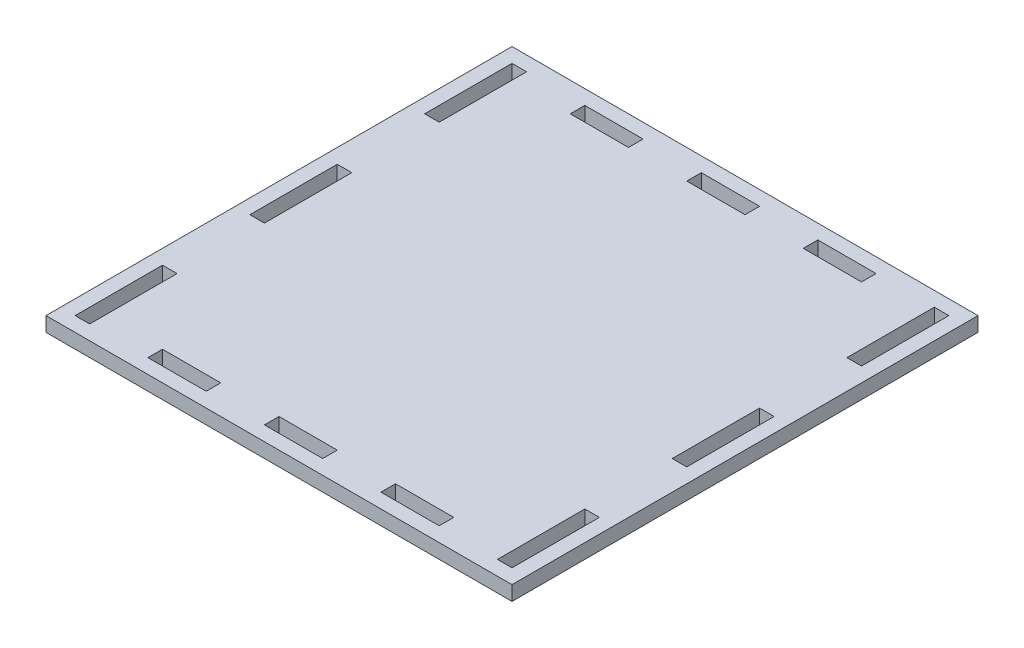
ISO-10303-21;
HEADER;
FILE_DESCRIPTION(('STEP AP214'),'2;1');
FILE_NAME('part.step','',(''),(''),'','','');
FILE_SCHEMA(('AUTOMOTIVE_DESIGN { 1 0 10303 214 1 1 1 1 }'));
ENDSEC;
DATA;
#1=APPLICATION_CONTEXT('core data for automotive mechanical design processes');
#2=APPLICATION_PROTOCOL_DEFINITION('international standard','automotive_design',2000,#1);
#3=PRODUCT_CONTEXT('',#1,'mechanical');
#4=PRODUCT('Part','Part','',(#3));
#5=PRODUCT_RELATED_PRODUCT_CATEGORY('part','',(#4));
#6=PRODUCT_DEFINITION_FORMATION('','',#4);
#7=PRODUCT_DEFINITION_CONTEXT('part definition',#1,'design');
#8=PRODUCT_DEFINITION('design','',#6,#7);
#9=PRODUCT_DEFINITION_SHAPE('','',#8);
#10=(LENGTH_UNIT() NAMED_UNIT(*) SI_UNIT(.MILLI.,.METRE.));
#11=(NAMED_UNIT(*) PLANE_ANGLE_UNIT() SI_UNIT($,.RADIAN.));
#12=(NAMED_UNIT(*) SI_UNIT($,.STERADIAN.) SOLID_ANGLE_UNIT());
#13=UNCERTAINTY_MEASURE_WITH_UNIT(LENGTH_MEASURE(1.E-05),#10,'distance_accuracy_value','');
#14=(GEOMETRIC_REPRESENTATION_CONTEXT(3) GLOBAL_UNCERTAINTY_ASSIGNED_CONTEXT((#13)) GLOBAL_UNIT_ASSIGNED_CONTEXT((#10,
#11,#12)) REPRESENTATION_CONTEXT('',''));
#15=CARTESIAN_POINT('',(0.,0.,0.));
#16=DIRECTION('',(0.,0.,1.));
#17=DIRECTION('',(1.,0.,0.));
#18=AXIS2_PLACEMENT_3D('',#15,#16,#17);
#19=CARTESIAN_POINT('',(0.,-12.7,-406.4));
#20=DIRECTION('',(0.,-1.,0.));
#21=DIRECTION('',(0.,0.,-1.));
#22=AXIS2_PLACEMENT_3D('',#19,#20,#21);
#23=PLANE('',#22);
#24=DIRECTION('',(0.,0.,-1.));
#25=VECTOR('',#24,1.);
#26=CARTESIAN_POINT('',(228.6,-12.7,-203.2));
#27=LINE('',#26,#25);
#28=CARTESIAN_POINT('',(228.6,-12.7,-381.));
#29=VERTEX_POINT('',#28);
#30=CARTESIAN_POINT('',(228.6,-12.7,-393.7));
#31=VERTEX_POINT('',#30);
#32=EDGE_CURVE('E407',#29,#31,#27,.T.);
#33=ORIENTED_EDGE('',*,*,#32,.T.);
#34=DIRECTION('',(1.,0.,0.));
#35=VECTOR('',#34,1.);
#36=CARTESIAN_POINT('',(-243.981421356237,-12.7,-393.7));
#37=LINE('',#36,#35);
#38=CARTESIAN_POINT('',(177.8,-12.7,-393.7));
#39=VERTEX_POINT('',#38);
#40=EDGE_CURVE('E398',#39,#31,#37,.T.);
#41=ORIENTED_EDGE('',*,*,#40,.F.);
#42=DIRECTION('',(0.,0.,1.));
#43=VECTOR('',#42,1.);
#44=CARTESIAN_POINT('',(177.8,-12.7,-203.2));
#45=LINE('',#44,#43);
#46=CARTESIAN_POINT('',(177.8,-12.7,-381.));
#47=VERTEX_POINT('',#46);
#48=EDGE_CURVE('E400',#39,#47,#45,.T.);
#49=ORIENTED_EDGE('',*,*,#48,.T.);
#50=DIRECTION('',(1.,0.,0.));
#51=VECTOR('',#50,1.);
#52=CARTESIAN_POINT('',(-243.981421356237,-12.7,-381.));
#53=LINE('',#52,#51);
#54=EDGE_CURVE('E404',#47,#29,#53,.T.);
#55=ORIENTED_EDGE('',*,*,#54,.T.);
#56=EDGE_LOOP('',(#33,#41,#49,#55));
#57=FACE_BOUND('',#56,.T.);
#58=DIRECTION('',(1.,0.,0.));
#59=VECTOR('',#58,1.);
#60=CARTESIAN_POINT('',(-243.981421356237,-12.7,-12.7));
#61=LINE('',#60,#59);
#62=CARTESIAN_POINT('',(279.4,-12.7,-12.7));
#63=VERTEX_POINT('',#62);
#64=CARTESIAN_POINT('',(330.2,-12.7,-12.7));
#65=VERTEX_POINT('',#64);
#66=EDGE_CURVE('E470',#63,#65,#61,.T.);
#67=ORIENTED_EDGE('',*,*,#66,.T.);
#68=DIRECTION('',(0.,0.,1.));
#69=VECTOR('',#68,1.);
#70=CARTESIAN_POINT('',(330.2,-12.7,-203.2));
#71=LINE('',#70,#69);
#72=CARTESIAN_POINT('',(330.2,-12.7,-25.4));
#73=VERTEX_POINT('',#72);
#74=EDGE_CURVE('E462',#73,#65,#71,.T.);
#75=ORIENTED_EDGE('',*,*,#74,.F.);
#76=DIRECTION('',(1.,0.,0.));
#77=VECTOR('',#76,1.);
#78=CARTESIAN_POINT('',(-243.981421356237,-12.7,-25.4));
#79=LINE('',#78,#77);
#80=CARTESIAN_POINT('',(279.4,-12.7,-25.4));
#81=VERTEX_POINT('',#80);
#82=EDGE_CURVE('E464',#81,#73,#79,.T.);
#83=ORIENTED_EDGE('',*,*,#82,.F.);
#84=DIRECTION('',(0.,0.,1.));
#85=VECTOR('',#84,1.);
#86=CARTESIAN_POINT('',(279.4,-12.7,-203.2));
#87=LINE('',#86,#85);
#88=EDGE_CURVE('E467',#81,#63,#87,.T.);
#89=ORIENTED_EDGE('',*,*,#88,.T.);
#90=EDGE_LOOP('',(#67,#75,#83,#89));
#91=FACE_BOUND('',#90,.T.);
#92=DIRECTION('',(1.,0.,0.));
#93=VECTOR('',#92,1.);
#94=CARTESIAN_POINT('',(-243.981421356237,-12.7,-25.4));
#95=LINE('',#94,#93);
#96=CARTESIAN_POINT('',(76.2,-12.7,-25.4));
#97=VERTEX_POINT('',#96);
#98=CARTESIAN_POINT('',(127.,-12.7,-25.4));
#99=VERTEX_POINT('',#98);
#100=EDGE_CURVE('E533',#97,#99,#95,.T.);
#101=ORIENTED_EDGE('',*,*,#100,.F.);
#102=DIRECTION('',(0.,0.,-1.));
#103=VECTOR('',#102,1.);
#104=CARTESIAN_POINT('',(76.2,-12.7,-203.2));
#105=LINE('',#104,#103);
#106=CARTESIAN_POINT('',(76.2,-12.7,-12.7));
#107=VERTEX_POINT('',#106);
#108=EDGE_CURVE('E524',#107,#97,#105,.T.);
#109=ORIENTED_EDGE('',*,*,#108,.F.);
#110=DIRECTION('',(1.,0.,0.));
#111=VECTOR('',#110,1.);
#112=CARTESIAN_POINT('',(-243.981421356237,-12.7,-12.7));
#113=LINE('',#112,#111);
#114=CARTESIAN_POINT('',(127.,-12.7,-12.6999999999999));
#115=VERTEX_POINT('',#114);
#116=EDGE_CURVE('E526',#107,#115,#113,.T.);
#117=ORIENTED_EDGE('',*,*,#116,.T.);
#118=DIRECTION('',(0.,0.,-1.));
#119=VECTOR('',#118,1.);
#120=CARTESIAN_POINT('',(127.,-12.7,-203.2));
#121=LINE('',#120,#119);
#122=EDGE_CURVE('E530',#115,#99,#121,.T.);
#123=ORIENTED_EDGE('',*,*,#122,.T.);
#124=EDGE_LOOP('',(#101,#109,#117,#123));
#125=FACE_BOUND('',#124,.T.);
#126=DIRECTION('',(1.,0.,0.));
#127=VECTOR('',#126,1.);
#128=CARTESIAN_POINT('',(-243.981421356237,-12.7,-241.3));
#129=LINE('',#128,#127);
#130=CARTESIAN_POINT('',(12.7,-12.7,-241.3));
#131=VERTEX_POINT('',#130);
#132=CARTESIAN_POINT('',(25.4,-12.7,-241.3));
#133=VERTEX_POINT('',#132);
#134=EDGE_CURVE('E597',#131,#133,#129,.T.);
#135=ORIENTED_EDGE('',*,*,#134,.F.);
#136=DIRECTION('',(0.,0.,-1.));
#137=VECTOR('',#136,1.);
#138=CARTESIAN_POINT('',(12.7,-12.7,-203.2));
#139=LINE('',#138,#137);
#140=CARTESIAN_POINT('',(12.7,-12.7,-165.1));
#141=VERTEX_POINT('',#140);
#142=EDGE_CURVE('E588',#141,#131,#139,.T.);
#143=ORIENTED_EDGE('',*,*,#142,.F.);
#144=DIRECTION('',(1.,0.,0.));
#145=VECTOR('',#144,1.);
#146=CARTESIAN_POINT('',(-243.981421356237,-12.7,-165.1));
#147=LINE('',#146,#145);
#148=CARTESIAN_POINT('',(25.4,-12.7,-165.1));
#149=VERTEX_POINT('',#148);
#150=EDGE_CURVE('E590',#141,#149,#147,.T.);
#151=ORIENTED_EDGE('',*,*,#150,.T.);
#152=DIRECTION('',(0.,0.,-1.));
#153=VECTOR('',#152,1.);
#154=CARTESIAN_POINT('',(25.4,-12.7,-203.2));
#155=LINE('',#154,#153);
#156=EDGE_CURVE('E594',#149,#133,#155,.T.);
#157=ORIENTED_EDGE('',*,*,#156,.T.);
#158=EDGE_LOOP('',(#135,#143,#151,#157));
#159=FACE_BOUND('',#158,.T.);
#160=DIRECTION('',(0.,0.,-1.));
#161=VECTOR('',#160,1.);
#162=CARTESIAN_POINT('',(381.,-12.7,-203.2));
#163=LINE('',#162,#161);
#164=CARTESIAN_POINT('',(381.,-12.7,-317.5));
#165=VERTEX_POINT('',#164);
#166=CARTESIAN_POINT('',(381.,-12.7,-393.7));
#167=VERTEX_POINT('',#166);
#168=EDGE_CURVE('E660',#165,#167,#163,.T.);
#169=ORIENTED_EDGE('',*,*,#168,.F.);
#170=DIRECTION('',(-1.,0.,0.));
#171=VECTOR('',#170,1.);
#172=CARTESIAN_POINT('',(-243.981421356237,-12.7,-317.5));
#173=LINE('',#172,#171);
#174=CARTESIAN_POINT('',(393.7,-12.7,-317.5));
#175=VERTEX_POINT('',#174);
#176=EDGE_CURVE('E651',#175,#165,#173,.T.);
#177=ORIENTED_EDGE('',*,*,#176,.F.);
#178=DIRECTION('',(0.,0.,-1.));
#179=VECTOR('',#178,1.);
#180=CARTESIAN_POINT('',(393.7,-12.7,-203.2));
#181=LINE('',#180,#179);
#182=CARTESIAN_POINT('',(393.7,-12.7,-393.7));
#183=VERTEX_POINT('',#182);
#184=EDGE_CURVE('E653',#175,#183,#181,.T.);
#185=ORIENTED_EDGE('',*,*,#184,.T.);
#186=DIRECTION('',(-1.,0.,0.));
#187=VECTOR('',#186,1.);
#188=CARTESIAN_POINT('',(-243.981421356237,-12.7,-393.7));
#189=LINE('',#188,#187);
#190=EDGE_CURVE('E657',#183,#167,#189,.T.);
#191=ORIENTED_EDGE('',*,*,#190,.T.);
#192=EDGE_LOOP('',(#169,#177,#185,#191));
#193=FACE_BOUND('',#192,.T.);
#194=DIRECTION('',(0.,0.,-1.));
#195=VECTOR('',#194,1.);
#196=CARTESIAN_POINT('',(381.,-12.7,-203.2));
#197=LINE('',#196,#195);
#198=CARTESIAN_POINT('',(381.,-12.7,-12.7));
#199=VERTEX_POINT('',#198);
#200=CARTESIAN_POINT('',(381.,-12.7,-88.9));
#201=VERTEX_POINT('',#200);
#202=EDGE_CURVE('E724',#199,#201,#197,.T.);
#203=ORIENTED_EDGE('',*,*,#202,.F.);
#204=DIRECTION('',(-1.,0.,0.));
#205=VECTOR('',#204,1.);
#206=CARTESIAN_POINT('',(-243.981421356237,-12.7,-12.7000000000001));
#207=LINE('',#206,#205);
#208=CARTESIAN_POINT('',(393.7,-12.7,-12.7));
#209=VERTEX_POINT('',#208);
#210=EDGE_CURVE('E715',#209,#199,#207,.T.);
#211=ORIENTED_EDGE('',*,*,#210,.F.);
#212=DIRECTION('',(0.,0.,-1.));
#213=VECTOR('',#212,1.);
#214=CARTESIAN_POINT('',(393.7,-12.7,-203.2));
#215=LINE('',#214,#213);
#216=CARTESIAN_POINT('',(393.7,-12.7,-88.9));
#217=VERTEX_POINT('',#216);
#218=EDGE_CURVE('E717',#209,#217,#215,.T.);
#219=ORIENTED_EDGE('',*,*,#218,.T.);
#220=DIRECTION('',(-1.,0.,0.));
#221=VECTOR('',#220,1.);
#222=CARTESIAN_POINT('',(-243.981421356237,-12.7,-88.9));
#223=LINE('',#222,#221);
#224=EDGE_CURVE('E721',#217,#201,#223,.T.);
#225=ORIENTED_EDGE('',*,*,#224,.T.);
#226=EDGE_LOOP('',(#203,#211,#219,#225));
#227=FACE_BOUND('',#226,.T.);
#228=DIRECTION('',(0.,0.,1.));
#229=VECTOR('',#228,1.);
#230=CARTESIAN_POINT('',(0.,-12.7,0.));
#231=LINE('',#230,#229);
#232=CARTESIAN_POINT('',(0.,-12.7,-406.4));
#233=VERTEX_POINT('',#232);
#234=CARTESIAN_POINT('',(0.,-12.7,0.));
#235=VERTEX_POINT('',#234);
#236=EDGE_CURVE('E747',#233,#235,#231,.T.);
#237=ORIENTED_EDGE('',*,*,#236,.F.);
#238=DIRECTION('',(-1.,0.,0.));
#239=VECTOR('',#238,1.);
#240=CARTESIAN_POINT('',(0.,-12.7,-406.4));
#241=LINE('',#240,#239);
#242=CARTESIAN_POINT('',(406.4,-12.7,-406.4));
#243=VERTEX_POINT('',#242);
#244=EDGE_CURVE('E757',#243,#233,#241,.T.);
#245=ORIENTED_EDGE('',*,*,#244,.F.);
#246=DIRECTION('',(0.,0.,-1.));
#247=VECTOR('',#246,1.);
#248=CARTESIAN_POINT('',(406.4,-12.7,0.));
#249=LINE('',#248,#247);
#250=CARTESIAN_POINT('',(406.4,-12.7,0.));
#251=VERTEX_POINT('',#250);
#252=EDGE_CURVE('E754',#251,#243,#249,.T.);
#253=ORIENTED_EDGE('',*,*,#252,.F.);
#254=DIRECTION('',(1.,0.,0.));
#255=VECTOR('',#254,1.);
#256=CARTESIAN_POINT('',(0.,-12.7,0.));
#257=LINE('',#256,#255);
#258=EDGE_CURVE('E750',#235,#251,#257,.T.);
#259=ORIENTED_EDGE('',*,*,#258,.F.);
#260=EDGE_LOOP('',(#237,#245,#253,#259));
#261=FACE_BOUND('',#260,.T.);
#262=DIRECTION('',(0.,0.,-1.));
#263=VECTOR('',#262,1.);
#264=CARTESIAN_POINT('',(381.,-12.7,-203.2));
#265=LINE('',#264,#263);
#266=CARTESIAN_POINT('',(381.,-12.7,-165.1));
#267=VERTEX_POINT('',#266);
#268=CARTESIAN_POINT('',(381.,-12.7,-241.3));
#269=VERTEX_POINT('',#268);
#270=EDGE_CURVE('E692',#267,#269,#265,.T.);
#271=ORIENTED_EDGE('',*,*,#270,.F.);
#272=DIRECTION('',(-1.,0.,0.));
#273=VECTOR('',#272,1.);
#274=CARTESIAN_POINT('',(-243.981421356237,-12.7,-165.1));
#275=LINE('',#274,#273);
#276=CARTESIAN_POINT('',(393.7,-12.7,-165.1));
#277=VERTEX_POINT('',#276);
#278=EDGE_CURVE('E683',#277,#267,#275,.T.);
#279=ORIENTED_EDGE('',*,*,#278,.F.);
#280=DIRECTION('',(0.,0.,-1.));
#281=VECTOR('',#280,1.);
#282=CARTESIAN_POINT('',(393.7,-12.7,-203.2));
#283=LINE('',#282,#281);
#284=CARTESIAN_POINT('',(393.7,-12.7,-241.3));
#285=VERTEX_POINT('',#284);
#286=EDGE_CURVE('E685',#277,#285,#283,.T.);
#287=ORIENTED_EDGE('',*,*,#286,.T.);
#288=DIRECTION('',(-1.,0.,0.));
#289=VECTOR('',#288,1.);
#290=CARTESIAN_POINT('',(-243.981421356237,-12.7,-241.3));
#291=LINE('',#290,#289);
#292=EDGE_CURVE('E689',#285,#269,#291,.T.);
#293=ORIENTED_EDGE('',*,*,#292,.T.);
#294=EDGE_LOOP('',(#271,#279,#287,#293));
#295=FACE_BOUND('',#294,.T.);
#296=DIRECTION('',(0.,0.,-1.));
#297=VECTOR('',#296,1.);
#298=CARTESIAN_POINT('',(25.4,-12.7,-203.2));
#299=LINE('',#298,#297);
#300=CARTESIAN_POINT('',(25.4,-12.7,-12.7));
#301=VERTEX_POINT('',#300);
#302=CARTESIAN_POINT('',(25.4,-12.7,-88.9));
#303=VERTEX_POINT('',#302);
#304=EDGE_CURVE('E628',#301,#303,#299,.T.);
#305=ORIENTED_EDGE('',*,*,#304,.T.);
#306=DIRECTION('',(1.,0.,0.));
#307=VECTOR('',#306,1.);
#308=CARTESIAN_POINT('',(-243.981421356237,-12.7,-88.9));
#309=LINE('',#308,#307);
#310=CARTESIAN_POINT('',(12.7,-12.7,-88.9));
#311=VERTEX_POINT('',#310);
#312=EDGE_CURVE('E620',#311,#303,#309,.T.);
#313=ORIENTED_EDGE('',*,*,#312,.F.);
#314=DIRECTION('',(0.,0.,-1.));
#315=VECTOR('',#314,1.);
#316=CARTESIAN_POINT('',(12.7,-12.7,-203.2));
#317=LINE('',#316,#315);
#318=CARTESIAN_POINT('',(12.7,-12.7,-12.7));
#319=VERTEX_POINT('',#318);
#320=EDGE_CURVE('E622',#319,#311,#317,.T.);
#321=ORIENTED_EDGE('',*,*,#320,.F.);
#322=DIRECTION('',(1.,0.,0.));
#323=VECTOR('',#322,1.);
#324=CARTESIAN_POINT('',(-243.981421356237,-12.7,-12.7));
#325=LINE('',#324,#323);
#326=EDGE_CURVE('E625',#319,#301,#325,.T.);
#327=ORIENTED_EDGE('',*,*,#326,.T.);
#328=EDGE_LOOP('',(#305,#313,#321,#327));
#329=FACE_BOUND('',#328,.T.);
#330=DIRECTION('',(1.,0.,0.));
#331=VECTOR('',#330,1.);
#332=CARTESIAN_POINT('',(-243.981421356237,-12.7,-393.7));
#333=LINE('',#332,#331);
#334=CARTESIAN_POINT('',(12.7,-12.7,-393.7));
#335=VERTEX_POINT('',#334);
#336=CARTESIAN_POINT('',(25.4,-12.7,-393.7));
#337=VERTEX_POINT('',#336);
#338=EDGE_CURVE('E565',#335,#337,#333,.T.);
#339=ORIENTED_EDGE('',*,*,#338,.F.);
#340=DIRECTION('',(0.,0.,-1.));
#341=VECTOR('',#340,1.);
#342=CARTESIAN_POINT('',(12.7,-12.7,-203.2));
#343=LINE('',#342,#341);
#344=CARTESIAN_POINT('',(12.7,-12.7,-317.5));
#345=VERTEX_POINT('',#344);
#346=EDGE_CURVE('E556',#345,#335,#343,.T.);
#347=ORIENTED_EDGE('',*,*,#346,.F.);
#348=DIRECTION('',(1.,0.,0.));
#349=VECTOR('',#348,1.);
#350=CARTESIAN_POINT('',(-243.981421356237,-12.7,-317.5));
#351=LINE('',#350,#349);
#352=CARTESIAN_POINT('',(25.4,-12.7,-317.5));
#353=VERTEX_POINT('',#352);
#354=EDGE_CURVE('E558',#345,#353,#351,.T.);
#355=ORIENTED_EDGE('',*,*,#354,.T.);
#356=DIRECTION('',(0.,0.,-1.));
#357=VECTOR('',#356,1.);
#358=CARTESIAN_POINT('',(25.4,-12.7,-203.2));
#359=LINE('',#358,#357);
#360=EDGE_CURVE('E562',#353,#337,#359,.T.);
#361=ORIENTED_EDGE('',*,*,#360,.T.);
#362=EDGE_LOOP('',(#339,#347,#355,#361));
#363=FACE_BOUND('',#362,.T.);
#364=DIRECTION('',(1.,0.,0.));
#365=VECTOR('',#364,1.);
#366=CARTESIAN_POINT('',(-243.981421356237,-12.7,-12.7));
#367=LINE('',#366,#365);
#368=CARTESIAN_POINT('',(177.8,-12.7,-12.7));
#369=VERTEX_POINT('',#368);
#370=CARTESIAN_POINT('',(228.6,-12.7,-12.7));
#371=VERTEX_POINT('',#370);
#372=EDGE_CURVE('E501',#369,#371,#367,.T.);
#373=ORIENTED_EDGE('',*,*,#372,.T.);
#374=DIRECTION('',(0.,0.,1.));
#375=VECTOR('',#374,1.);
#376=CARTESIAN_POINT('',(228.6,-12.7,-203.2));
#377=LINE('',#376,#375);
#378=CARTESIAN_POINT('',(228.6,-12.7,-25.4));
#379=VERTEX_POINT('',#378);
#380=EDGE_CURVE('E493',#379,#371,#377,.T.);
#381=ORIENTED_EDGE('',*,*,#380,.F.);
#382=DIRECTION('',(1.,0.,0.));
#383=VECTOR('',#382,1.);
#384=CARTESIAN_POINT('',(-243.981421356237,-12.7,-25.4));
#385=LINE('',#384,#383);
#386=CARTESIAN_POINT('',(177.8,-12.7,-25.4));
#387=VERTEX_POINT('',#386);
#388=EDGE_CURVE('E495',#387,#379,#385,.T.);
#389=ORIENTED_EDGE('',*,*,#388,.F.);
#390=DIRECTION('',(0.,0.,-1.));
#391=VECTOR('',#390,1.);
#392=CARTESIAN_POINT('',(177.8,-12.7,-203.2));
#393=LINE('',#392,#391);
#394=EDGE_CURVE('E498',#369,#387,#393,.T.);
#395=ORIENTED_EDGE('',*,*,#394,.F.);
#396=EDGE_LOOP('',(#373,#381,#389,#395));
#397=FACE_BOUND('',#396,.T.);
#398=DIRECTION('',(0.,0.,1.));
#399=VECTOR('',#398,1.);
#400=CARTESIAN_POINT('',(127.,-12.7,-203.2));
#401=LINE('',#400,#399);
#402=CARTESIAN_POINT('',(127.,-12.7,-393.7));
#403=VERTEX_POINT('',#402);
#404=CARTESIAN_POINT('',(127.,-12.7,-381.));
#405=VERTEX_POINT('',#404);
#406=EDGE_CURVE('E439',#403,#405,#401,.T.);
#407=ORIENTED_EDGE('',*,*,#406,.F.);
#408=DIRECTION('',(1.,0.,0.));
#409=VECTOR('',#408,1.);
#410=CARTESIAN_POINT('',(-243.981421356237,-12.7,-393.7));
#411=LINE('',#410,#409);
#412=CARTESIAN_POINT('',(76.2,-12.7,-393.7));
#413=VERTEX_POINT('',#412);
#414=EDGE_CURVE('E430',#413,#403,#411,.T.);
#415=ORIENTED_EDGE('',*,*,#414,.F.);
#416=DIRECTION('',(0.,0.,1.));
#417=VECTOR('',#416,1.);
#418=CARTESIAN_POINT('',(76.2,-12.7,-203.2));
#419=LINE('',#418,#417);
#420=CARTESIAN_POINT('',(76.2,-12.7,-381.));
#421=VERTEX_POINT('',#420);
#422=EDGE_CURVE('E432',#413,#421,#419,.T.);
#423=ORIENTED_EDGE('',*,*,#422,.T.);
#424=DIRECTION('',(1.,0.,0.));
#425=VECTOR('',#424,1.);
#426=CARTESIAN_POINT('',(-243.981421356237,-12.7,-381.));
#427=LINE('',#426,#425);
#428=EDGE_CURVE('E436',#421,#405,#427,.T.);
#429=ORIENTED_EDGE('',*,*,#428,.T.);
#430=EDGE_LOOP('',(#407,#415,#423,#429));
#431=FACE_BOUND('',#430,.T.);
#432=DIRECTION('',(0.,0.,-1.));
#433=VECTOR('',#432,1.);
#434=CARTESIAN_POINT('',(330.2,-12.7,-203.2));
#435=LINE('',#434,#433);
#436=CARTESIAN_POINT('',(330.2,-12.7,-381.));
#437=VERTEX_POINT('',#436);
#438=CARTESIAN_POINT('',(330.2,-12.7,-393.7));
#439=VERTEX_POINT('',#438);
#440=EDGE_CURVE('E375',#437,#439,#435,.T.);
#441=ORIENTED_EDGE('',*,*,#440,.T.);
#442=DIRECTION('',(1.,0.,0.));
#443=VECTOR('',#442,1.);
#444=CARTESIAN_POINT('',(-243.981421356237,-12.7,-393.7));
#445=LINE('',#444,#443);
#446=CARTESIAN_POINT('',(279.4,-12.7,-393.7));
#447=VERTEX_POINT('',#446);
#448=EDGE_CURVE('E371',#447,#439,#445,.T.);
#449=ORIENTED_EDGE('',*,*,#448,.F.);
#450=DIRECTION('',(0.,0.,-1.));
#451=VECTOR('',#450,1.);
#452=CARTESIAN_POINT('',(279.4,-12.7,-203.2));
#453=LINE('',#452,#451);
#454=CARTESIAN_POINT('',(279.4,-12.7,-381.));
#455=VERTEX_POINT('',#454);
#456=EDGE_CURVE('E363',#455,#447,#453,.T.);
#457=ORIENTED_EDGE('',*,*,#456,.F.);
#458=DIRECTION('',(1.,0.,0.));
#459=VECTOR('',#458,1.);
#460=CARTESIAN_POINT('',(-243.981421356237,-12.7,-381.));
#461=LINE('',#460,#459);
#462=EDGE_CURVE('E50',#455,#437,#461,.T.);
#463=ORIENTED_EDGE('',*,*,#462,.T.);
#464=EDGE_LOOP('',(#441,#449,#457,#463));
#465=FACE_BOUND('',#464,.T.);
#466=ADVANCED_FACE('F33',(#57,#91,#125,#159,#193,#227,#261,#295,#329,#363,#397,#431,#465),#23,.T.);
#467=CARTESIAN_POINT('',(0.,0.,-406.4));
#468=DIRECTION('',(0.,-1.,0.));
#469=DIRECTION('',(0.,0.,-1.));
#470=AXIS2_PLACEMENT_3D('',#467,#468,#469);
#471=PLANE('',#470);
#472=DIRECTION('',(1.,0.,0.));
#473=VECTOR('',#472,1.);
#474=CARTESIAN_POINT('',(-243.981421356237,0.,-393.7));
#475=LINE('',#474,#473);
#476=CARTESIAN_POINT('',(177.8,0.,-393.7));
#477=VERTEX_POINT('',#476);
#478=CARTESIAN_POINT('',(228.6,0.,-393.7));
#479=VERTEX_POINT('',#478);
#480=EDGE_CURVE('E394',#477,#479,#475,.T.);
#481=ORIENTED_EDGE('',*,*,#480,.T.);
#482=DIRECTION('',(0.,0.,-1.));
#483=VECTOR('',#482,1.);
#484=CARTESIAN_POINT('',(228.6,0.,-203.2));
#485=LINE('',#484,#483);
#486=CARTESIAN_POINT('',(228.6,0.,-381.));
#487=VERTEX_POINT('',#486);
#488=EDGE_CURVE('E401',#487,#479,#485,.T.);
#489=ORIENTED_EDGE('',*,*,#488,.F.);
#490=DIRECTION('',(1.,0.,0.));
#491=VECTOR('',#490,1.);
#492=CARTESIAN_POINT('',(-243.981421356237,0.,-381.));
#493=LINE('',#492,#491);
#494=CARTESIAN_POINT('',(177.8,0.,-381.));
#495=VERTEX_POINT('',#494);
#496=EDGE_CURVE('E416',#495,#487,#493,.T.);
#497=ORIENTED_EDGE('',*,*,#496,.F.);
#498=DIRECTION('',(0.,0.,1.));
#499=VECTOR('',#498,1.);
#500=CARTESIAN_POINT('',(177.8,0.,-203.2));
#501=LINE('',#500,#499);
#502=EDGE_CURVE('E413',#477,#495,#501,.T.);
#503=ORIENTED_EDGE('',*,*,#502,.F.);
#504=EDGE_LOOP('',(#481,#489,#497,#503));
#505=FACE_BOUND('',#504,.T.);
#506=DIRECTION('',(0.,0.,1.));
#507=VECTOR('',#506,1.);
#508=CARTESIAN_POINT('',(330.2,0.,-203.2));
#509=LINE('',#508,#507);
#510=CARTESIAN_POINT('',(330.2,0.,-25.4));
#511=VERTEX_POINT('',#510);
#512=CARTESIAN_POINT('',(330.2,0.,-12.7));
#513=VERTEX_POINT('',#512);
#514=EDGE_CURVE('E455',#511,#513,#509,.T.);
#515=ORIENTED_EDGE('',*,*,#514,.T.);
#516=DIRECTION('',(1.,0.,0.));
#517=VECTOR('',#516,1.);
#518=CARTESIAN_POINT('',(-243.981421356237,0.,-12.7));
#519=LINE('',#518,#517);
#520=CARTESIAN_POINT('',(279.4,0.,-12.7));
#521=VERTEX_POINT('',#520);
#522=EDGE_CURVE('E465',#521,#513,#519,.T.);
#523=ORIENTED_EDGE('',*,*,#522,.F.);
#524=DIRECTION('',(0.,0.,1.));
#525=VECTOR('',#524,1.);
#526=CARTESIAN_POINT('',(279.4,0.,-203.2));
#527=LINE('',#526,#525);
#528=CARTESIAN_POINT('',(279.4,0.,-25.4));
#529=VERTEX_POINT('',#528);
#530=EDGE_CURVE('E479',#529,#521,#527,.T.);
#531=ORIENTED_EDGE('',*,*,#530,.F.);
#532=DIRECTION('',(1.,0.,0.));
#533=VECTOR('',#532,1.);
#534=CARTESIAN_POINT('',(-243.981421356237,0.,-25.4));
#535=LINE('',#534,#533);
#536=EDGE_CURVE('E476',#529,#511,#535,.T.);
#537=ORIENTED_EDGE('',*,*,#536,.T.);
#538=EDGE_LOOP('',(#515,#523,#531,#537));
#539=FACE_BOUND('',#538,.T.);
#540=DIRECTION('',(0.,0.,-1.));
#541=VECTOR('',#540,1.);
#542=CARTESIAN_POINT('',(76.2,0.,-203.2));
#543=LINE('',#542,#541);
#544=CARTESIAN_POINT('',(76.2,0.,-12.6999999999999));
#545=VERTEX_POINT('',#544);
#546=CARTESIAN_POINT('',(76.2,0.,-25.4));
#547=VERTEX_POINT('',#546);
#548=EDGE_CURVE('E517',#545,#547,#543,.T.);
#549=ORIENTED_EDGE('',*,*,#548,.T.);
#550=DIRECTION('',(1.,0.,0.));
#551=VECTOR('',#550,1.);
#552=CARTESIAN_POINT('',(-243.981421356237,0.,-25.4));
#553=LINE('',#552,#551);
#554=CARTESIAN_POINT('',(127.,0.,-25.4));
#555=VERTEX_POINT('',#554);
#556=EDGE_CURVE('E527',#547,#555,#553,.T.);
#557=ORIENTED_EDGE('',*,*,#556,.T.);
#558=DIRECTION('',(0.,0.,-1.));
#559=VECTOR('',#558,1.);
#560=CARTESIAN_POINT('',(127.,0.,-203.2));
#561=LINE('',#560,#559);
#562=CARTESIAN_POINT('',(127.,0.,-12.7));
#563=VERTEX_POINT('',#562);
#564=EDGE_CURVE('E541',#563,#555,#561,.T.);
#565=ORIENTED_EDGE('',*,*,#564,.F.);
#566=DIRECTION('',(1.,0.,0.));
#567=VECTOR('',#566,1.);
#568=CARTESIAN_POINT('',(-243.981421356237,0.,-12.7));
#569=LINE('',#568,#567);
#570=EDGE_CURVE('E538',#545,#563,#569,.T.);
#571=ORIENTED_EDGE('',*,*,#570,.F.);
#572=EDGE_LOOP('',(#549,#557,#565,#571));
#573=FACE_BOUND('',#572,.T.);
#574=DIRECTION('',(0.,0.,-1.));
#575=VECTOR('',#574,1.);
#576=CARTESIAN_POINT('',(12.7,0.,-203.2));
#577=LINE('',#576,#575);
#578=CARTESIAN_POINT('',(12.7,0.,-165.1));
#579=VERTEX_POINT('',#578);
#580=CARTESIAN_POINT('',(12.7,0.,-241.3));
#581=VERTEX_POINT('',#580);
#582=EDGE_CURVE('E581',#579,#581,#577,.T.);
#583=ORIENTED_EDGE('',*,*,#582,.T.);
#584=DIRECTION('',(1.,0.,0.));
#585=VECTOR('',#584,1.);
#586=CARTESIAN_POINT('',(-243.981421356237,0.,-241.3));
#587=LINE('',#586,#585);
#588=CARTESIAN_POINT('',(25.4,0.,-241.3));
#589=VERTEX_POINT('',#588);
#590=EDGE_CURVE('E591',#581,#589,#587,.T.);
#591=ORIENTED_EDGE('',*,*,#590,.T.);
#592=DIRECTION('',(0.,0.,-1.));
#593=VECTOR('',#592,1.);
#594=CARTESIAN_POINT('',(25.4,0.,-203.2));
#595=LINE('',#594,#593);
#596=CARTESIAN_POINT('',(25.4,0.,-165.1));
#597=VERTEX_POINT('',#596);
#598=EDGE_CURVE('E605',#597,#589,#595,.T.);
#599=ORIENTED_EDGE('',*,*,#598,.F.);
#600=DIRECTION('',(1.,0.,0.));
#601=VECTOR('',#600,1.);
#602=CARTESIAN_POINT('',(-243.981421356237,0.,-165.1));
#603=LINE('',#602,#601);
#604=EDGE_CURVE('E602',#579,#597,#603,.T.);
#605=ORIENTED_EDGE('',*,*,#604,.F.);
#606=EDGE_LOOP('',(#583,#591,#599,#605));
#607=FACE_BOUND('',#606,.T.);
#608=DIRECTION('',(-1.,0.,0.));
#609=VECTOR('',#608,1.);
#610=CARTESIAN_POINT('',(-243.981421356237,0.,-317.5));
#611=LINE('',#610,#609);
#612=CARTESIAN_POINT('',(393.7,0.,-317.5));
#613=VERTEX_POINT('',#612);
#614=CARTESIAN_POINT('',(381.,0.,-317.5));
#615=VERTEX_POINT('',#614);
#616=EDGE_CURVE('E644',#613,#615,#611,.T.);
#617=ORIENTED_EDGE('',*,*,#616,.T.);
#618=DIRECTION('',(0.,0.,-1.));
#619=VECTOR('',#618,1.);
#620=CARTESIAN_POINT('',(381.,0.,-203.2));
#621=LINE('',#620,#619);
#622=CARTESIAN_POINT('',(381.,0.,-393.7));
#623=VERTEX_POINT('',#622);
#624=EDGE_CURVE('E654',#615,#623,#621,.T.);
#625=ORIENTED_EDGE('',*,*,#624,.T.);
#626=DIRECTION('',(-1.,0.,0.));
#627=VECTOR('',#626,1.);
#628=CARTESIAN_POINT('',(-243.981421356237,0.,-393.7));
#629=LINE('',#628,#627);
#630=CARTESIAN_POINT('',(393.7,0.,-393.7));
#631=VERTEX_POINT('',#630);
#632=EDGE_CURVE('E668',#631,#623,#629,.T.);
#633=ORIENTED_EDGE('',*,*,#632,.F.);
#634=DIRECTION('',(0.,0.,-1.));
#635=VECTOR('',#634,1.);
#636=CARTESIAN_POINT('',(393.7,0.,-203.2));
#637=LINE('',#636,#635);
#638=EDGE_CURVE('E665',#613,#631,#637,.T.);
#639=ORIENTED_EDGE('',*,*,#638,.F.);
#640=EDGE_LOOP('',(#617,#625,#633,#639));
#641=FACE_BOUND('',#640,.T.);
#642=DIRECTION('',(-1.,0.,0.));
#643=VECTOR('',#642,1.);
#644=CARTESIAN_POINT('',(-243.981421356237,0.,-12.7000000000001));
#645=LINE('',#644,#643);
#646=CARTESIAN_POINT('',(393.7,0.,-12.7));
#647=VERTEX_POINT('',#646);
#648=CARTESIAN_POINT('',(381.,0.,-12.7));
#649=VERTEX_POINT('',#648);
#650=EDGE_CURVE('E708',#647,#649,#645,.T.);
#651=ORIENTED_EDGE('',*,*,#650,.T.);
#652=DIRECTION('',(0.,0.,-1.));
#653=VECTOR('',#652,1.);
#654=CARTESIAN_POINT('',(381.,0.,-203.2));
#655=LINE('',#654,#653);
#656=CARTESIAN_POINT('',(381.,0.,-88.9));
#657=VERTEX_POINT('',#656);
#658=EDGE_CURVE('E718',#649,#657,#655,.T.);
#659=ORIENTED_EDGE('',*,*,#658,.T.);
#660=DIRECTION('',(-1.,0.,0.));
#661=VECTOR('',#660,1.);
#662=CARTESIAN_POINT('',(-243.981421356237,0.,-88.9));
#663=LINE('',#662,#661);
#664=CARTESIAN_POINT('',(393.7,0.,-88.9));
#665=VERTEX_POINT('',#664);
#666=EDGE_CURVE('E732',#665,#657,#663,.T.);
#667=ORIENTED_EDGE('',*,*,#666,.F.);
#668=DIRECTION('',(0.,0.,-1.));
#669=VECTOR('',#668,1.);
#670=CARTESIAN_POINT('',(393.7,0.,-203.2));
#671=LINE('',#670,#669);
#672=EDGE_CURVE('E729',#647,#665,#671,.T.);
#673=ORIENTED_EDGE('',*,*,#672,.F.);
#674=EDGE_LOOP('',(#651,#659,#667,#673));
#675=FACE_BOUND('',#674,.T.);
#676=DIRECTION('',(0.,0.,1.));
#677=VECTOR('',#676,1.);
#678=CARTESIAN_POINT('',(0.,0.,0.));
#679=LINE('',#678,#677);
#680=CARTESIAN_POINT('',(0.,0.,-406.4));
#681=VERTEX_POINT('',#680);
#682=CARTESIAN_POINT('',(0.,0.,0.));
#683=VERTEX_POINT('',#682);
#684=EDGE_CURVE('E740',#681,#683,#679,.T.);
#685=ORIENTED_EDGE('',*,*,#684,.T.);
#686=DIRECTION('',(1.,0.,0.));
#687=VECTOR('',#686,1.);
#688=CARTESIAN_POINT('',(0.,0.,0.));
#689=LINE('',#688,#687);
#690=CARTESIAN_POINT('',(406.4,0.,0.));
#691=VERTEX_POINT('',#690);
#692=EDGE_CURVE('E762',#683,#691,#689,.T.);
#693=ORIENTED_EDGE('',*,*,#692,.T.);
#694=DIRECTION('',(0.,0.,-1.));
#695=VECTOR('',#694,1.);
#696=CARTESIAN_POINT('',(406.4,0.,0.));
#697=LINE('',#696,#695);
#698=CARTESIAN_POINT('',(406.4,0.,-406.4));
#699=VERTEX_POINT('',#698);
#700=EDGE_CURVE('E765',#691,#699,#697,.T.);
#701=ORIENTED_EDGE('',*,*,#700,.T.);
#702=DIRECTION('',(-1.,0.,0.));
#703=VECTOR('',#702,1.);
#704=CARTESIAN_POINT('',(0.,0.,-406.4));
#705=LINE('',#704,#703);
#706=EDGE_CURVE('E751',#699,#681,#705,.T.);
#707=ORIENTED_EDGE('',*,*,#706,.T.);
#708=EDGE_LOOP('',(#685,#693,#701,#707));
#709=FACE_BOUND('',#708,.T.);
#710=DIRECTION('',(-1.,0.,0.));
#711=VECTOR('',#710,1.);
#712=CARTESIAN_POINT('',(-243.981421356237,0.,-165.1));
#713=LINE('',#712,#711);
#714=CARTESIAN_POINT('',(393.7,0.,-165.1));
#715=VERTEX_POINT('',#714);
#716=CARTESIAN_POINT('',(381.,0.,-165.1));
#717=VERTEX_POINT('',#716);
#718=EDGE_CURVE('E676',#715,#717,#713,.T.);
#719=ORIENTED_EDGE('',*,*,#718,.T.);
#720=DIRECTION('',(0.,0.,-1.));
#721=VECTOR('',#720,1.);
#722=CARTESIAN_POINT('',(381.,0.,-203.2));
#723=LINE('',#722,#721);
#724=CARTESIAN_POINT('',(381.,0.,-241.3));
#725=VERTEX_POINT('',#724);
#726=EDGE_CURVE('E686',#717,#725,#723,.T.);
#727=ORIENTED_EDGE('',*,*,#726,.T.);
#728=DIRECTION('',(-1.,0.,0.));
#729=VECTOR('',#728,1.);
#730=CARTESIAN_POINT('',(-243.981421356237,0.,-241.3));
#731=LINE('',#730,#729);
#732=CARTESIAN_POINT('',(393.7,0.,-241.3));
#733=VERTEX_POINT('',#732);
#734=EDGE_CURVE('E700',#733,#725,#731,.T.);
#735=ORIENTED_EDGE('',*,*,#734,.F.);
#736=DIRECTION('',(0.,0.,-1.));
#737=VECTOR('',#736,1.);
#738=CARTESIAN_POINT('',(393.7,0.,-203.2));
#739=LINE('',#738,#737);
#740=EDGE_CURVE('E697',#715,#733,#739,.T.);
#741=ORIENTED_EDGE('',*,*,#740,.F.);
#742=EDGE_LOOP('',(#719,#727,#735,#741));
#743=FACE_BOUND('',#742,.T.);
#744=DIRECTION('',(1.,0.,0.));
#745=VECTOR('',#744,1.);
#746=CARTESIAN_POINT('',(-243.981421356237,0.,-88.9));
#747=LINE('',#746,#745);
#748=CARTESIAN_POINT('',(12.7,0.,-88.9));
#749=VERTEX_POINT('',#748);
#750=CARTESIAN_POINT('',(25.4,0.,-88.9));
#751=VERTEX_POINT('',#750);
#752=EDGE_CURVE('E613',#749,#751,#747,.T.);
#753=ORIENTED_EDGE('',*,*,#752,.T.);
#754=DIRECTION('',(0.,0.,-1.));
#755=VECTOR('',#754,1.);
#756=CARTESIAN_POINT('',(25.4,0.,-203.2));
#757=LINE('',#756,#755);
#758=CARTESIAN_POINT('',(25.4,0.,-12.7));
#759=VERTEX_POINT('',#758);
#760=EDGE_CURVE('E623',#759,#751,#757,.T.);
#761=ORIENTED_EDGE('',*,*,#760,.F.);
#762=DIRECTION('',(1.,0.,0.));
#763=VECTOR('',#762,1.);
#764=CARTESIAN_POINT('',(-243.981421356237,0.,-12.7));
#765=LINE('',#764,#763);
#766=CARTESIAN_POINT('',(12.7,0.,-12.7));
#767=VERTEX_POINT('',#766);
#768=EDGE_CURVE('E637',#767,#759,#765,.T.);
#769=ORIENTED_EDGE('',*,*,#768,.F.);
#770=DIRECTION('',(0.,0.,-1.));
#771=VECTOR('',#770,1.);
#772=CARTESIAN_POINT('',(12.7,0.,-203.2));
#773=LINE('',#772,#771);
#774=EDGE_CURVE('E634',#767,#749,#773,.T.);
#775=ORIENTED_EDGE('',*,*,#774,.T.);
#776=EDGE_LOOP('',(#753,#761,#769,#775));
#777=FACE_BOUND('',#776,.T.);
#778=DIRECTION('',(0.,0.,-1.));
#779=VECTOR('',#778,1.);
#780=CARTESIAN_POINT('',(12.7,0.,-203.2));
#781=LINE('',#780,#779);
#782=CARTESIAN_POINT('',(12.7,0.,-317.5));
#783=VERTEX_POINT('',#782);
#784=CARTESIAN_POINT('',(12.7,0.,-393.7));
#785=VERTEX_POINT('',#784);
#786=EDGE_CURVE('E549',#783,#785,#781,.T.);
#787=ORIENTED_EDGE('',*,*,#786,.T.);
#788=DIRECTION('',(1.,0.,0.));
#789=VECTOR('',#788,1.);
#790=CARTESIAN_POINT('',(-243.981421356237,0.,-393.7));
#791=LINE('',#790,#789);
#792=CARTESIAN_POINT('',(25.4,0.,-393.7));
#793=VERTEX_POINT('',#792);
#794=EDGE_CURVE('E559',#785,#793,#791,.T.);
#795=ORIENTED_EDGE('',*,*,#794,.T.);
#796=DIRECTION('',(0.,0.,-1.));
#797=VECTOR('',#796,1.);
#798=CARTESIAN_POINT('',(25.4,0.,-203.2));
#799=LINE('',#798,#797);
#800=CARTESIAN_POINT('',(25.4,0.,-317.5));
#801=VERTEX_POINT('',#800);
#802=EDGE_CURVE('E573',#801,#793,#799,.T.);
#803=ORIENTED_EDGE('',*,*,#802,.F.);
#804=DIRECTION('',(1.,0.,0.));
#805=VECTOR('',#804,1.);
#806=CARTESIAN_POINT('',(-243.981421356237,0.,-317.5));
#807=LINE('',#806,#805);
#808=EDGE_CURVE('E570',#783,#801,#807,.T.);
#809=ORIENTED_EDGE('',*,*,#808,.F.);
#810=EDGE_LOOP('',(#787,#795,#803,#809));
#811=FACE_BOUND('',#810,.T.);
#812=DIRECTION('',(0.,0.,1.));
#813=VECTOR('',#812,1.);
#814=CARTESIAN_POINT('',(228.6,0.,-203.2));
#815=LINE('',#814,#813);
#816=CARTESIAN_POINT('',(228.6,0.,-25.4));
#817=VERTEX_POINT('',#816);
#818=CARTESIAN_POINT('',(228.6,0.,-12.7));
#819=VERTEX_POINT('',#818);
#820=EDGE_CURVE('E486',#817,#819,#815,.T.);
#821=ORIENTED_EDGE('',*,*,#820,.T.);
#822=DIRECTION('',(1.,0.,0.));
#823=VECTOR('',#822,1.);
#824=CARTESIAN_POINT('',(-243.981421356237,0.,-12.7));
#825=LINE('',#824,#823);
#826=CARTESIAN_POINT('',(177.8,0.,-12.7));
#827=VERTEX_POINT('',#826);
#828=EDGE_CURVE('E496',#827,#819,#825,.T.);
#829=ORIENTED_EDGE('',*,*,#828,.F.);
#830=DIRECTION('',(0.,0.,-1.));
#831=VECTOR('',#830,1.);
#832=CARTESIAN_POINT('',(177.8,0.,-203.2));
#833=LINE('',#832,#831);
#834=CARTESIAN_POINT('',(177.8,0.,-25.4));
#835=VERTEX_POINT('',#834);
#836=EDGE_CURVE('E510',#827,#835,#833,.T.);
#837=ORIENTED_EDGE('',*,*,#836,.T.);
#838=DIRECTION('',(1.,0.,0.));
#839=VECTOR('',#838,1.);
#840=CARTESIAN_POINT('',(-243.981421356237,0.,-25.4));
#841=LINE('',#840,#839);
#842=EDGE_CURVE('E507',#835,#817,#841,.T.);
#843=ORIENTED_EDGE('',*,*,#842,.T.);
#844=EDGE_LOOP('',(#821,#829,#837,#843));
#845=FACE_BOUND('',#844,.T.);
#846=DIRECTION('',(1.,0.,0.));
#847=VECTOR('',#846,1.);
#848=CARTESIAN_POINT('',(-243.981421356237,0.,-393.7));
#849=LINE('',#848,#847);
#850=CARTESIAN_POINT('',(76.2,0.,-393.7));
#851=VERTEX_POINT('',#850);
#852=CARTESIAN_POINT('',(127.,0.,-393.7));
#853=VERTEX_POINT('',#852);
#854=EDGE_CURVE('E423',#851,#853,#849,.T.);
#855=ORIENTED_EDGE('',*,*,#854,.T.);
#856=DIRECTION('',(0.,0.,1.));
#857=VECTOR('',#856,1.);
#858=CARTESIAN_POINT('',(127.,0.,-203.2));
#859=LINE('',#858,#857);
#860=CARTESIAN_POINT('',(127.,0.,-381.));
#861=VERTEX_POINT('',#860);
#862=EDGE_CURVE('E433',#853,#861,#859,.T.);
#863=ORIENTED_EDGE('',*,*,#862,.T.);
#864=DIRECTION('',(1.,0.,0.));
#865=VECTOR('',#864,1.);
#866=CARTESIAN_POINT('',(-243.981421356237,0.,-381.));
#867=LINE('',#866,#865);
#868=CARTESIAN_POINT('',(76.2,0.,-381.));
#869=VERTEX_POINT('',#868);
#870=EDGE_CURVE('E447',#869,#861,#867,.T.);
#871=ORIENTED_EDGE('',*,*,#870,.F.);
#872=DIRECTION('',(0.,0.,1.));
#873=VECTOR('',#872,1.);
#874=CARTESIAN_POINT('',(76.2,0.,-203.2));
#875=LINE('',#874,#873);
#876=EDGE_CURVE('E444',#851,#869,#875,.T.);
#877=ORIENTED_EDGE('',*,*,#876,.F.);
#878=EDGE_LOOP('',(#855,#863,#871,#877));
#879=FACE_BOUND('',#878,.T.);
#880=DIRECTION('',(1.,0.,0.));
#881=VECTOR('',#880,1.);
#882=CARTESIAN_POINT('',(-243.981421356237,0.,-393.7));
#883=LINE('',#882,#881);
#884=CARTESIAN_POINT('',(279.4,0.,-393.7));
#885=VERTEX_POINT('',#884);
#886=CARTESIAN_POINT('',(330.2,0.,-393.7));
#887=VERTEX_POINT('',#886);
#888=EDGE_CURVE('E58',#885,#887,#883,.T.);
#889=ORIENTED_EDGE('',*,*,#888,.T.);
#890=DIRECTION('',(0.,0.,-1.));
#891=VECTOR('',#890,1.);
#892=CARTESIAN_POINT('',(330.2,0.,-203.2));
#893=LINE('',#892,#891);
#894=CARTESIAN_POINT('',(330.2,0.,-381.));
#895=VERTEX_POINT('',#894);
#896=EDGE_CURVE('E379',#895,#887,#893,.T.);
#897=ORIENTED_EDGE('',*,*,#896,.F.);
#898=DIRECTION('',(1.,0.,0.));
#899=VECTOR('',#898,1.);
#900=CARTESIAN_POINT('',(-243.981421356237,0.,-381.));
#901=LINE('',#900,#899);
#902=CARTESIAN_POINT('',(279.4,0.,-381.));
#903=VERTEX_POINT('',#902);
#904=EDGE_CURVE('E382',#903,#895,#901,.T.);
#905=ORIENTED_EDGE('',*,*,#904,.F.);
#906=DIRECTION('',(0.,0.,-1.));
#907=VECTOR('',#906,1.);
#908=CARTESIAN_POINT('',(279.4,0.,-203.2));
#909=LINE('',#908,#907);
#910=EDGE_CURVE('E388',#903,#885,#909,.T.);
#911=ORIENTED_EDGE('',*,*,#910,.T.);
#912=EDGE_LOOP('',(#889,#897,#905,#911));
#913=FACE_BOUND('',#912,.T.);
#914=ADVANCED_FACE('F780',(#505,#539,#573,#607,#641,#675,#709,#743,#777,#811,#845,#879,#913),
#471,.F.);
#915=CARTESIAN_POINT('',(0.,-12.7,0.));
#916=DIRECTION('',(-1.,0.,0.));
#917=DIRECTION('',(0.,0.,1.));
#918=AXIS2_PLACEMENT_3D('',#915,#916,#917);
#919=PLANE('',#918);
#920=ORIENTED_EDGE('',*,*,#684,.F.);
#921=DIRECTION('',(0.,1.,0.));
#922=VECTOR('',#921,1.);
#923=CARTESIAN_POINT('',(0.,-12.7,-406.4));
#924=LINE('',#923,#922);
#925=EDGE_CURVE('E11',#233,#681,#924,.T.);
#926=ORIENTED_EDGE('',*,*,#925,.F.);
#927=ORIENTED_EDGE('',*,*,#236,.T.);
#928=DIRECTION('',(0.,1.,0.));
#929=VECTOR('',#928,1.);
#930=CARTESIAN_POINT('',(0.,-12.7,0.));
#931=LINE('',#930,#929);
#932=EDGE_CURVE('E37',#235,#683,#931,.T.);
#933=ORIENTED_EDGE('',*,*,#932,.T.);
#934=EDGE_LOOP('',(#920,#926,#927,#933));
#935=FACE_BOUND('',#934,.T.);
#936=ADVANCED_FACE('F35',(#935),#919,.T.);
#937=CARTESIAN_POINT('',(0.,-12.7,-406.4));
#938=DIRECTION('',(0.,0.,-1.));
#939=DIRECTION('',(-1.,0.,0.));
#940=AXIS2_PLACEMENT_3D('',#937,#938,#939);
#941=PLANE('',#940);
#942=ORIENTED_EDGE('',*,*,#706,.F.);
#943=DIRECTION('',(0.,1.,0.));
#944=VECTOR('',#943,1.);
#945=CARTESIAN_POINT('',(406.4,-12.7,-406.4));
#946=LINE('',#945,#944);
#947=EDGE_CURVE('E42',#243,#699,#946,.T.);
#948=ORIENTED_EDGE('',*,*,#947,.F.);
#949=ORIENTED_EDGE('',*,*,#244,.T.);
#950=ORIENTED_EDGE('',*,*,#925,.T.);
#951=EDGE_LOOP('',(#942,#948,#949,#950));
#952=FACE_BOUND('',#951,.T.);
#953=ADVANCED_FACE('F784',(#952),#941,.T.);
#954=CARTESIAN_POINT('',(406.4,-12.7,0.));
#955=DIRECTION('',(1.,0.,0.));
#956=DIRECTION('',(0.,0.,-1.));
#957=AXIS2_PLACEMENT_3D('',#954,#955,#956);
#958=PLANE('',#957);
#959=ORIENTED_EDGE('',*,*,#700,.F.);
#960=DIRECTION('',(0.,1.,0.));
#961=VECTOR('',#960,1.);
#962=CARTESIAN_POINT('',(406.4,-12.7,0.));
#963=LINE('',#962,#961);
#964=EDGE_CURVE('E770',#251,#691,#963,.T.);
#965=ORIENTED_EDGE('',*,*,#964,.F.);
#966=ORIENTED_EDGE('',*,*,#252,.T.);
#967=ORIENTED_EDGE('',*,*,#947,.T.);
#968=EDGE_LOOP('',(#959,#965,#966,#967));
#969=FACE_BOUND('',#968,.T.);
#970=ADVANCED_FACE('F790',(#969),#958,.T.);
#971=CARTESIAN_POINT('',(0.,-12.7,0.));
#972=DIRECTION('',(0.,0.,1.));
#973=DIRECTION('',(1.,0.,0.));
#974=AXIS2_PLACEMENT_3D('',#971,#972,#973);
#975=PLANE('',#974);
#976=ORIENTED_EDGE('',*,*,#692,.F.);
#977=ORIENTED_EDGE('',*,*,#932,.F.);
#978=ORIENTED_EDGE('',*,*,#258,.T.);
#979=ORIENTED_EDGE('',*,*,#964,.T.);
#980=EDGE_LOOP('',(#976,#977,#978,#979));
#981=FACE_BOUND('',#980,.T.);
#982=ADVANCED_FACE('F778',(#981),#975,.T.);
#983=CARTESIAN_POINT('',(-243.981421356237,-12.7,-12.7000000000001));
#984=DIRECTION('',(0.,0.,-1.));
#985=DIRECTION('',(-1.,0.,0.));
#986=AXIS2_PLACEMENT_3D('',#983,#984,#985);
#987=PLANE('',#986);
#988=ORIENTED_EDGE('',*,*,#650,.F.);
#989=DIRECTION('',(0.,1.,0.));
#990=VECTOR('',#989,1.);
#991=CARTESIAN_POINT('',(393.7,-12.7,-12.7));
#992=LINE('',#991,#990);
#993=EDGE_CURVE('E726',#209,#647,#992,.T.);
#994=ORIENTED_EDGE('',*,*,#993,.F.);
#995=ORIENTED_EDGE('',*,*,#210,.T.);
#996=DIRECTION('',(0.,1.,0.));
#997=VECTOR('',#996,1.);
#998=CARTESIAN_POINT('',(381.,-12.7,-12.7));
#999=LINE('',#998,#997);
#1000=EDGE_CURVE('E737',#199,#649,#999,.T.);
#1001=ORIENTED_EDGE('',*,*,#1000,.T.);
#1002=EDGE_LOOP('',(#988,#994,#995,#1001));
#1003=FACE_BOUND('',#1002,.T.);
#1004=ADVANCED_FACE('F797',(#1003),#987,.T.);
#1005=CARTESIAN_POINT('',(381.,-12.7,-203.2));
#1006=DIRECTION('',(1.,0.,0.));
#1007=DIRECTION('',(0.,0.,-1.));
#1008=AXIS2_PLACEMENT_3D('',#1005,#1006,#1007);
#1009=PLANE('',#1008);
#1010=ORIENTED_EDGE('',*,*,#658,.F.);
#1011=ORIENTED_EDGE('',*,*,#1000,.F.);
#1012=ORIENTED_EDGE('',*,*,#202,.T.);
#1013=DIRECTION('',(0.,1.,0.));
#1014=VECTOR('',#1013,1.);
#1015=CARTESIAN_POINT('',(381.,-12.7,-88.9));
#1016=LINE('',#1015,#1014);
#1017=EDGE_CURVE('E741',#201,#657,#1016,.T.);
#1018=ORIENTED_EDGE('',*,*,#1017,.T.);
#1019=EDGE_LOOP('',(#1010,#1011,#1012,#1018));
#1020=FACE_BOUND('',#1019,.T.);
#1021=ADVANCED_FACE('F811',(#1020),#1009,.T.);
#1022=CARTESIAN_POINT('',(-243.981421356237,-12.7,-88.9));
#1023=DIRECTION('',(0.,0.,-1.));
#1024=DIRECTION('',(-1.,0.,0.));
#1025=AXIS2_PLACEMENT_3D('',#1022,#1023,#1024);
#1026=PLANE('',#1025);
#1027=ORIENTED_EDGE('',*,*,#666,.T.);
#1028=ORIENTED_EDGE('',*,*,#1017,.F.);
#1029=ORIENTED_EDGE('',*,*,#224,.F.);
#1030=DIRECTION('',(0.,1.,0.));
#1031=VECTOR('',#1030,1.);
#1032=CARTESIAN_POINT('',(393.7,-12.7,-88.9));
#1033=LINE('',#1032,#1031);
#1034=EDGE_CURVE('E743',#217,#665,#1033,.T.);
#1035=ORIENTED_EDGE('',*,*,#1034,.T.);
#1036=EDGE_LOOP('',(#1027,#1028,#1029,#1035));
#1037=FACE_BOUND('',#1036,.T.);
#1038=ADVANCED_FACE('F817',(#1037),#1026,.F.);
#1039=CARTESIAN_POINT('',(393.7,-12.7,-203.2));
#1040=DIRECTION('',(1.,0.,0.));
#1041=DIRECTION('',(0.,0.,-1.));
#1042=AXIS2_PLACEMENT_3D('',#1039,#1040,#1041);
#1043=PLANE('',#1042);
#1044=ORIENTED_EDGE('',*,*,#672,.T.);
#1045=ORIENTED_EDGE('',*,*,#1034,.F.);
#1046=ORIENTED_EDGE('',*,*,#218,.F.);
#1047=ORIENTED_EDGE('',*,*,#993,.T.);
#1048=EDGE_LOOP('',(#1044,#1045,#1046,#1047));
#1049=FACE_BOUND('',#1048,.T.);
#1050=ADVANCED_FACE('F813',(#1049),#1043,.F.);
#1051=CARTESIAN_POINT('',(-243.981421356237,-12.7,-165.1));
#1052=DIRECTION('',(0.,0.,-1.));
#1053=DIRECTION('',(-1.,0.,0.));
#1054=AXIS2_PLACEMENT_3D('',#1051,#1052,#1053);
#1055=PLANE('',#1054);
#1056=ORIENTED_EDGE('',*,*,#718,.F.);
#1057=DIRECTION('',(0.,1.,0.));
#1058=VECTOR('',#1057,1.);
#1059=CARTESIAN_POINT('',(393.7,-12.7,-165.1));
#1060=LINE('',#1059,#1058);
#1061=EDGE_CURVE('E694',#277,#715,#1060,.T.);
#1062=ORIENTED_EDGE('',*,*,#1061,.F.);
#1063=ORIENTED_EDGE('',*,*,#278,.T.);
#1064=DIRECTION('',(0.,1.,0.));
#1065=VECTOR('',#1064,1.);
#1066=CARTESIAN_POINT('',(381.,-12.7,-165.1));
#1067=LINE('',#1066,#1065);
#1068=EDGE_CURVE('E705',#267,#717,#1067,.T.);
#1069=ORIENTED_EDGE('',*,*,#1068,.T.);
#1070=EDGE_LOOP('',(#1056,#1062,#1063,#1069));
#1071=FACE_BOUND('',#1070,.T.);
#1072=ADVANCED_FACE('F816',(#1071),#1055,.T.);
#1073=CARTESIAN_POINT('',(381.,-12.7,-203.2));
#1074=DIRECTION('',(1.,0.,0.));
#1075=DIRECTION('',(0.,0.,-1.));
#1076=AXIS2_PLACEMENT_3D('',#1073,#1074,#1075);
#1077=PLANE('',#1076);
#1078=ORIENTED_EDGE('',*,*,#726,.F.);
#1079=ORIENTED_EDGE('',*,*,#1068,.F.);
#1080=ORIENTED_EDGE('',*,*,#270,.T.);
#1081=DIRECTION('',(0.,1.,0.));
#1082=VECTOR('',#1081,1.);
#1083=CARTESIAN_POINT('',(381.,-12.7,-241.3));
#1084=LINE('',#1083,#1082);
#1085=EDGE_CURVE('E709',#269,#725,#1084,.T.);
#1086=ORIENTED_EDGE('',*,*,#1085,.T.);
#1087=EDGE_LOOP('',(#1078,#1079,#1080,#1086));
#1088=FACE_BOUND('',#1087,.T.);
#1089=ADVANCED_FACE('F827',(#1088),#1077,.T.);
#1090=CARTESIAN_POINT('',(-243.981421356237,-12.7,-241.3));
#1091=DIRECTION('',(0.,0.,-1.));
#1092=DIRECTION('',(-1.,0.,0.));
#1093=AXIS2_PLACEMENT_3D('',#1090,#1091,#1092);
#1094=PLANE('',#1093);
#1095=ORIENTED_EDGE('',*,*,#734,.T.);
#1096=ORIENTED_EDGE('',*,*,#1085,.F.);
#1097=ORIENTED_EDGE('',*,*,#292,.F.);
#1098=DIRECTION('',(0.,1.,0.));
#1099=VECTOR('',#1098,1.);
#1100=CARTESIAN_POINT('',(393.7,-12.7,-241.3));
#1101=LINE('',#1100,#1099);
#1102=EDGE_CURVE('E711',#285,#733,#1101,.T.);
#1103=ORIENTED_EDGE('',*,*,#1102,.T.);
#1104=EDGE_LOOP('',(#1095,#1096,#1097,#1103));
#1105=FACE_BOUND('',#1104,.T.);
#1106=ADVANCED_FACE('F833',(#1105),#1094,.F.);
#1107=CARTESIAN_POINT('',(393.7,-12.7,-203.2));
#1108=DIRECTION('',(1.,0.,0.));
#1109=DIRECTION('',(0.,0.,-1.));
#1110=AXIS2_PLACEMENT_3D('',#1107,#1108,#1109);
#1111=PLANE('',#1110);
#1112=ORIENTED_EDGE('',*,*,#740,.T.);
#1113=ORIENTED_EDGE('',*,*,#1102,.F.);
#1114=ORIENTED_EDGE('',*,*,#286,.F.);
#1115=ORIENTED_EDGE('',*,*,#1061,.T.);
#1116=EDGE_LOOP('',(#1112,#1113,#1114,#1115));
#1117=FACE_BOUND('',#1116,.T.);
#1118=ADVANCED_FACE('F829',(#1117),#1111,.F.);
#1119=CARTESIAN_POINT('',(-243.981421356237,-12.7,-317.5));
#1120=DIRECTION('',(0.,0.,-1.));
#1121=DIRECTION('',(-1.,0.,0.));
#1122=AXIS2_PLACEMENT_3D('',#1119,#1120,#1121);
#1123=PLANE('',#1122);
#1124=ORIENTED_EDGE('',*,*,#616,.F.);
#1125=DIRECTION('',(0.,1.,0.));
#1126=VECTOR('',#1125,1.);
#1127=CARTESIAN_POINT('',(393.7,-12.7,-317.5));
#1128=LINE('',#1127,#1126);
#1129=EDGE_CURVE('E662',#175,#613,#1128,.T.);
#1130=ORIENTED_EDGE('',*,*,#1129,.F.);
#1131=ORIENTED_EDGE('',*,*,#176,.T.);
#1132=DIRECTION('',(0.,1.,0.));
#1133=VECTOR('',#1132,1.);
#1134=CARTESIAN_POINT('',(381.,-12.7,-317.5));
#1135=LINE('',#1134,#1133);
#1136=EDGE_CURVE('E673',#165,#615,#1135,.T.);
#1137=ORIENTED_EDGE('',*,*,#1136,.T.);
#1138=EDGE_LOOP('',(#1124,#1130,#1131,#1137));
#1139=FACE_BOUND('',#1138,.T.);
#1140=ADVANCED_FACE('F832',(#1139),#1123,.T.);
#1141=CARTESIAN_POINT('',(381.,-12.7,-203.2));
#1142=DIRECTION('',(1.,0.,0.));
#1143=DIRECTION('',(0.,0.,-1.));
#1144=AXIS2_PLACEMENT_3D('',#1141,#1142,#1143);
#1145=PLANE('',#1144);
#1146=ORIENTED_EDGE('',*,*,#624,.F.);
#1147=ORIENTED_EDGE('',*,*,#1136,.F.);
#1148=ORIENTED_EDGE('',*,*,#168,.T.);
#1149=DIRECTION('',(0.,1.,0.));
#1150=VECTOR('',#1149,1.);
#1151=CARTESIAN_POINT('',(381.,-12.7,-393.7));
#1152=LINE('',#1151,#1150);
#1153=EDGE_CURVE('E677',#167,#623,#1152,.T.);
#1154=ORIENTED_EDGE('',*,*,#1153,.T.);
#1155=EDGE_LOOP('',(#1146,#1147,#1148,#1154));
#1156=FACE_BOUND('',#1155,.T.);
#1157=ADVANCED_FACE('F843',(#1156),#1145,.T.);
#1158=CARTESIAN_POINT('',(-243.981421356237,-12.7,-393.7));
#1159=DIRECTION('',(0.,0.,-1.));
#1160=DIRECTION('',(-1.,0.,0.));
#1161=AXIS2_PLACEMENT_3D('',#1158,#1159,#1160);
#1162=PLANE('',#1161);
#1163=ORIENTED_EDGE('',*,*,#632,.T.);
#1164=ORIENTED_EDGE('',*,*,#1153,.F.);
#1165=ORIENTED_EDGE('',*,*,#190,.F.);
#1166=DIRECTION('',(0.,1.,0.));
#1167=VECTOR('',#1166,1.);
#1168=CARTESIAN_POINT('',(393.7,-12.7,-393.7));
#1169=LINE('',#1168,#1167);
#1170=EDGE_CURVE('E679',#183,#631,#1169,.T.);
#1171=ORIENTED_EDGE('',*,*,#1170,.T.);
#1172=EDGE_LOOP('',(#1163,#1164,#1165,#1171));
#1173=FACE_BOUND('',#1172,.T.);
#1174=ADVANCED_FACE('F849',(#1173),#1162,.F.);
#1175=CARTESIAN_POINT('',(393.7,-12.7,-203.2));
#1176=DIRECTION('',(1.,0.,0.));
#1177=DIRECTION('',(0.,0.,-1.));
#1178=AXIS2_PLACEMENT_3D('',#1175,#1176,#1177);
#1179=PLANE('',#1178);
#1180=ORIENTED_EDGE('',*,*,#638,.T.);
#1181=ORIENTED_EDGE('',*,*,#1170,.F.);
#1182=ORIENTED_EDGE('',*,*,#184,.F.);
#1183=ORIENTED_EDGE('',*,*,#1129,.T.);
#1184=EDGE_LOOP('',(#1180,#1181,#1182,#1183));
#1185=FACE_BOUND('',#1184,.T.);
#1186=ADVANCED_FACE('F845',(#1185),#1179,.F.);
#1187=CARTESIAN_POINT('',(-243.981421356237,-12.7,-88.9));
#1188=DIRECTION('',(0.,0.,1.));
#1189=DIRECTION('',(1.,0.,0.));
#1190=AXIS2_PLACEMENT_3D('',#1187,#1188,#1189);
#1191=PLANE('',#1190);
#1192=ORIENTED_EDGE('',*,*,#752,.F.);
#1193=DIRECTION('',(0.,1.,0.));
#1194=VECTOR('',#1193,1.);
#1195=CARTESIAN_POINT('',(12.7,-12.7,-88.9));
#1196=LINE('',#1195,#1194);
#1197=EDGE_CURVE('E631',#311,#749,#1196,.T.);
#1198=ORIENTED_EDGE('',*,*,#1197,.F.);
#1199=ORIENTED_EDGE('',*,*,#312,.T.);
#1200=DIRECTION('',(0.,1.,0.));
#1201=VECTOR('',#1200,1.);
#1202=CARTESIAN_POINT('',(25.4,-12.7,-88.9));
#1203=LINE('',#1202,#1201);
#1204=EDGE_CURVE('E642',#303,#751,#1203,.T.);
#1205=ORIENTED_EDGE('',*,*,#1204,.T.);
#1206=EDGE_LOOP('',(#1192,#1198,#1199,#1205));
#1207=FACE_BOUND('',#1206,.T.);
#1208=ADVANCED_FACE('F848',(#1207),#1191,.T.);
#1209=CARTESIAN_POINT('',(25.4,-12.7,-203.2));
#1210=DIRECTION('',(1.,0.,0.));
#1211=DIRECTION('',(0.,0.,-1.));
#1212=AXIS2_PLACEMENT_3D('',#1209,#1210,#1211);
#1213=PLANE('',#1212);
#1214=ORIENTED_EDGE('',*,*,#760,.T.);
#1215=ORIENTED_EDGE('',*,*,#1204,.F.);
#1216=ORIENTED_EDGE('',*,*,#304,.F.);
#1217=DIRECTION('',(0.,1.,0.));
#1218=VECTOR('',#1217,1.);
#1219=CARTESIAN_POINT('',(25.4,-12.7,-12.7));
#1220=LINE('',#1219,#1218);
#1221=EDGE_CURVE('E645',#301,#759,#1220,.T.);
#1222=ORIENTED_EDGE('',*,*,#1221,.T.);
#1223=EDGE_LOOP('',(#1214,#1215,#1216,#1222));
#1224=FACE_BOUND('',#1223,.T.);
#1225=ADVANCED_FACE('F859',(#1224),#1213,.F.);
#1226=CARTESIAN_POINT('',(-243.981421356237,-12.7,-12.7));
#1227=DIRECTION('',(0.,0.,1.));
#1228=DIRECTION('',(1.,0.,0.));
#1229=AXIS2_PLACEMENT_3D('',#1226,#1227,#1228);
#1230=PLANE('',#1229);
#1231=ORIENTED_EDGE('',*,*,#768,.T.);
#1232=ORIENTED_EDGE('',*,*,#1221,.F.);
#1233=ORIENTED_EDGE('',*,*,#326,.F.);
#1234=DIRECTION('',(0.,1.,0.));
#1235=VECTOR('',#1234,1.);
#1236=CARTESIAN_POINT('',(12.7,-12.7,-12.7));
#1237=LINE('',#1236,#1235);
#1238=EDGE_CURVE('E647',#319,#767,#1237,.T.);
#1239=ORIENTED_EDGE('',*,*,#1238,.T.);
#1240=EDGE_LOOP('',(#1231,#1232,#1233,#1239));
#1241=FACE_BOUND('',#1240,.T.);
#1242=ADVANCED_FACE('F865',(#1241),#1230,.F.);
#1243=CARTESIAN_POINT('',(12.7,-12.7,-203.2));
#1244=DIRECTION('',(1.,0.,0.));
#1245=DIRECTION('',(0.,0.,-1.));
#1246=AXIS2_PLACEMENT_3D('',#1243,#1244,#1245);
#1247=PLANE('',#1246);
#1248=ORIENTED_EDGE('',*,*,#774,.F.);
#1249=ORIENTED_EDGE('',*,*,#1238,.F.);
#1250=ORIENTED_EDGE('',*,*,#320,.T.);
#1251=ORIENTED_EDGE('',*,*,#1197,.T.);
#1252=EDGE_LOOP('',(#1248,#1249,#1250,#1251));
#1253=FACE_BOUND('',#1252,.T.);
#1254=ADVANCED_FACE('F861',(#1253),#1247,.T.);
#1255=CARTESIAN_POINT('',(12.7,-12.7,-203.2));
#1256=DIRECTION('',(1.,0.,0.));
#1257=DIRECTION('',(0.,0.,-1.));
#1258=AXIS2_PLACEMENT_3D('',#1255,#1256,#1257);
#1259=PLANE('',#1258);
#1260=ORIENTED_EDGE('',*,*,#582,.F.);
#1261=DIRECTION('',(0.,1.,0.));
#1262=VECTOR('',#1261,1.);
#1263=CARTESIAN_POINT('',(12.7,-12.7,-165.1));
#1264=LINE('',#1263,#1262);
#1265=EDGE_CURVE('E599',#141,#579,#1264,.T.);
#1266=ORIENTED_EDGE('',*,*,#1265,.F.);
#1267=ORIENTED_EDGE('',*,*,#142,.T.);
#1268=DIRECTION('',(0.,1.,0.));
#1269=VECTOR('',#1268,1.);
#1270=CARTESIAN_POINT('',(12.7,-12.7,-241.3));
#1271=LINE('',#1270,#1269);
#1272=EDGE_CURVE('E610',#131,#581,#1271,.T.);
#1273=ORIENTED_EDGE('',*,*,#1272,.T.);
#1274=EDGE_LOOP('',(#1260,#1266,#1267,#1273));
#1275=FACE_BOUND('',#1274,.T.);
#1276=ADVANCED_FACE('F864',(#1275),#1259,.T.);
#1277=CARTESIAN_POINT('',(-243.981421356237,-12.7,-241.3));
#1278=DIRECTION('',(0.,0.,1.));
#1279=DIRECTION('',(1.,0.,0.));
#1280=AXIS2_PLACEMENT_3D('',#1277,#1278,#1279);
#1281=PLANE('',#1280);
#1282=ORIENTED_EDGE('',*,*,#590,.F.);
#1283=ORIENTED_EDGE('',*,*,#1272,.F.);
#1284=ORIENTED_EDGE('',*,*,#134,.T.);
#1285=DIRECTION('',(0.,1.,0.));
#1286=VECTOR('',#1285,1.);
#1287=CARTESIAN_POINT('',(25.4,-12.7,-241.3));
#1288=LINE('',#1287,#1286);
#1289=EDGE_CURVE('E614',#133,#589,#1288,.T.);
#1290=ORIENTED_EDGE('',*,*,#1289,.T.);
#1291=EDGE_LOOP('',(#1282,#1283,#1284,#1290));
#1292=FACE_BOUND('',#1291,.T.);
#1293=ADVANCED_FACE('F875',(#1292),#1281,.T.);
#1294=CARTESIAN_POINT('',(25.4,-12.7,-203.2));
#1295=DIRECTION('',(1.,0.,0.));
#1296=DIRECTION('',(0.,0.,-1.));
#1297=AXIS2_PLACEMENT_3D('',#1294,#1295,#1296);
#1298=PLANE('',#1297);
#1299=ORIENTED_EDGE('',*,*,#598,.T.);
#1300=ORIENTED_EDGE('',*,*,#1289,.F.);
#1301=ORIENTED_EDGE('',*,*,#156,.F.);
#1302=DIRECTION('',(0.,1.,0.));
#1303=VECTOR('',#1302,1.);
#1304=CARTESIAN_POINT('',(25.4,-12.7,-165.1));
#1305=LINE('',#1304,#1303);
#1306=EDGE_CURVE('E616',#149,#597,#1305,.T.);
#1307=ORIENTED_EDGE('',*,*,#1306,.T.);
#1308=EDGE_LOOP('',(#1299,#1300,#1301,#1307));
#1309=FACE_BOUND('',#1308,.T.);
#1310=ADVANCED_FACE('F881',(#1309),#1298,.F.);
#1311=CARTESIAN_POINT('',(-243.981421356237,-12.7,-165.1));
#1312=DIRECTION('',(0.,0.,1.));
#1313=DIRECTION('',(1.,0.,0.));
#1314=AXIS2_PLACEMENT_3D('',#1311,#1312,#1313);
#1315=PLANE('',#1314);
#1316=ORIENTED_EDGE('',*,*,#604,.T.);
#1317=ORIENTED_EDGE('',*,*,#1306,.F.);
#1318=ORIENTED_EDGE('',*,*,#150,.F.);
#1319=ORIENTED_EDGE('',*,*,#1265,.T.);
#1320=EDGE_LOOP('',(#1316,#1317,#1318,#1319));
#1321=FACE_BOUND('',#1320,.T.);
#1322=ADVANCED_FACE('F877',(#1321),#1315,.F.);
#1323=CARTESIAN_POINT('',(12.7,-12.7,-203.2));
#1324=DIRECTION('',(1.,0.,0.));
#1325=DIRECTION('',(0.,0.,-1.));
#1326=AXIS2_PLACEMENT_3D('',#1323,#1324,#1325);
#1327=PLANE('',#1326);
#1328=ORIENTED_EDGE('',*,*,#786,.F.);
#1329=DIRECTION('',(0.,1.,0.));
#1330=VECTOR('',#1329,1.);
#1331=CARTESIAN_POINT('',(12.7,-12.7,-317.5));
#1332=LINE('',#1331,#1330);
#1333=EDGE_CURVE('E567',#345,#783,#1332,.T.);
#1334=ORIENTED_EDGE('',*,*,#1333,.F.);
#1335=ORIENTED_EDGE('',*,*,#346,.T.);
#1336=DIRECTION('',(0.,1.,0.));
#1337=VECTOR('',#1336,1.);
#1338=CARTESIAN_POINT('',(12.7,-12.7,-393.7));
#1339=LINE('',#1338,#1337);
#1340=EDGE_CURVE('E578',#335,#785,#1339,.T.);
#1341=ORIENTED_EDGE('',*,*,#1340,.T.);
#1342=EDGE_LOOP('',(#1328,#1334,#1335,#1341));
#1343=FACE_BOUND('',#1342,.T.);
#1344=ADVANCED_FACE('F880',(#1343),#1327,.T.);
#1345=CARTESIAN_POINT('',(-243.981421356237,-12.7,-393.7));
#1346=DIRECTION('',(0.,0.,1.));
#1347=DIRECTION('',(1.,0.,0.));
#1348=AXIS2_PLACEMENT_3D('',#1345,#1346,#1347);
#1349=PLANE('',#1348);
#1350=ORIENTED_EDGE('',*,*,#794,.F.);
#1351=ORIENTED_EDGE('',*,*,#1340,.F.);
#1352=ORIENTED_EDGE('',*,*,#338,.T.);
#1353=DIRECTION('',(0.,1.,0.));
#1354=VECTOR('',#1353,1.);
#1355=CARTESIAN_POINT('',(25.4,-12.7,-393.7));
#1356=LINE('',#1355,#1354);
#1357=EDGE_CURVE('E582',#337,#793,#1356,.T.);
#1358=ORIENTED_EDGE('',*,*,#1357,.T.);
#1359=EDGE_LOOP('',(#1350,#1351,#1352,#1358));
#1360=FACE_BOUND('',#1359,.T.);
#1361=ADVANCED_FACE('F891',(#1360),#1349,.T.);
#1362=CARTESIAN_POINT('',(25.4,-12.7,-203.2));
#1363=DIRECTION('',(1.,0.,0.));
#1364=DIRECTION('',(0.,0.,-1.));
#1365=AXIS2_PLACEMENT_3D('',#1362,#1363,#1364);
#1366=PLANE('',#1365);
#1367=ORIENTED_EDGE('',*,*,#802,.T.);
#1368=ORIENTED_EDGE('',*,*,#1357,.F.);
#1369=ORIENTED_EDGE('',*,*,#360,.F.);
#1370=DIRECTION('',(0.,1.,0.));
#1371=VECTOR('',#1370,1.);
#1372=CARTESIAN_POINT('',(25.4,-12.7,-317.5));
#1373=LINE('',#1372,#1371);
#1374=EDGE_CURVE('E584',#353,#801,#1373,.T.);
#1375=ORIENTED_EDGE('',*,*,#1374,.T.);
#1376=EDGE_LOOP('',(#1367,#1368,#1369,#1375));
#1377=FACE_BOUND('',#1376,.T.);
#1378=ADVANCED_FACE('F897',(#1377),#1366,.F.);
#1379=CARTESIAN_POINT('',(-243.981421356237,-12.7,-317.5));
#1380=DIRECTION('',(0.,0.,1.));
#1381=DIRECTION('',(1.,0.,0.));
#1382=AXIS2_PLACEMENT_3D('',#1379,#1380,#1381);
#1383=PLANE('',#1382);
#1384=ORIENTED_EDGE('',*,*,#808,.T.);
#1385=ORIENTED_EDGE('',*,*,#1374,.F.);
#1386=ORIENTED_EDGE('',*,*,#354,.F.);
#1387=ORIENTED_EDGE('',*,*,#1333,.T.);
#1388=EDGE_LOOP('',(#1384,#1385,#1386,#1387));
#1389=FACE_BOUND('',#1388,.T.);
#1390=ADVANCED_FACE('F893',(#1389),#1383,.F.);
#1391=CARTESIAN_POINT('',(76.2,-12.7,-203.2));
#1392=DIRECTION('',(1.,0.,0.));
#1393=DIRECTION('',(0.,0.,-1.));
#1394=AXIS2_PLACEMENT_3D('',#1391,#1392,#1393);
#1395=PLANE('',#1394);
#1396=ORIENTED_EDGE('',*,*,#548,.F.);
#1397=DIRECTION('',(0.,1.,0.));
#1398=VECTOR('',#1397,1.);
#1399=CARTESIAN_POINT('',(76.2,-12.7,-12.7));
#1400=LINE('',#1399,#1398);
#1401=EDGE_CURVE('E535',#107,#545,#1400,.T.);
#1402=ORIENTED_EDGE('',*,*,#1401,.F.);
#1403=ORIENTED_EDGE('',*,*,#108,.T.);
#1404=DIRECTION('',(0.,1.,0.));
#1405=VECTOR('',#1404,1.);
#1406=CARTESIAN_POINT('',(76.2,-12.7,-25.4));
#1407=LINE('',#1406,#1405);
#1408=EDGE_CURVE('E546',#97,#547,#1407,.T.);
#1409=ORIENTED_EDGE('',*,*,#1408,.T.);
#1410=EDGE_LOOP('',(#1396,#1402,#1403,#1409));
#1411=FACE_BOUND('',#1410,.T.);
#1412=ADVANCED_FACE('F896',(#1411),#1395,.T.);
#1413=CARTESIAN_POINT('',(-243.981421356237,-12.7,-25.4));
#1414=DIRECTION('',(0.,0.,1.));
#1415=DIRECTION('',(1.,0.,0.));
#1416=AXIS2_PLACEMENT_3D('',#1413,#1414,#1415);
#1417=PLANE('',#1416);
#1418=ORIENTED_EDGE('',*,*,#556,.F.);
#1419=ORIENTED_EDGE('',*,*,#1408,.F.);
#1420=ORIENTED_EDGE('',*,*,#100,.T.);
#1421=DIRECTION('',(0.,1.,0.));
#1422=VECTOR('',#1421,1.);
#1423=CARTESIAN_POINT('',(127.,-12.7,-25.4));
#1424=LINE('',#1423,#1422);
#1425=EDGE_CURVE('E550',#99,#555,#1424,.T.);
#1426=ORIENTED_EDGE('',*,*,#1425,.T.);
#1427=EDGE_LOOP('',(#1418,#1419,#1420,#1426));
#1428=FACE_BOUND('',#1427,.T.);
#1429=ADVANCED_FACE('F907',(#1428),#1417,.T.);
#1430=CARTESIAN_POINT('',(127.,-12.7,-203.2));
#1431=DIRECTION('',(1.,0.,0.));
#1432=DIRECTION('',(0.,0.,-1.));
#1433=AXIS2_PLACEMENT_3D('',#1430,#1431,#1432);
#1434=PLANE('',#1433);
#1435=ORIENTED_EDGE('',*,*,#564,.T.);
#1436=ORIENTED_EDGE('',*,*,#1425,.F.);
#1437=ORIENTED_EDGE('',*,*,#122,.F.);
#1438=DIRECTION('',(0.,1.,0.));
#1439=VECTOR('',#1438,1.);
#1440=CARTESIAN_POINT('',(127.,-12.7,-12.7));
#1441=LINE('',#1440,#1439);
#1442=EDGE_CURVE('E552',#115,#563,#1441,.T.);
#1443=ORIENTED_EDGE('',*,*,#1442,.T.);
#1444=EDGE_LOOP('',(#1435,#1436,#1437,#1443));
#1445=FACE_BOUND('',#1444,.T.);
#1446=ADVANCED_FACE('F913',(#1445),#1434,.F.);
#1447=CARTESIAN_POINT('',(-243.981421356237,-12.7,-12.7));
#1448=DIRECTION('',(0.,0.,1.));
#1449=DIRECTION('',(1.,0.,0.));
#1450=AXIS2_PLACEMENT_3D('',#1447,#1448,#1449);
#1451=PLANE('',#1450);
#1452=ORIENTED_EDGE('',*,*,#570,.T.);
#1453=ORIENTED_EDGE('',*,*,#1442,.F.);
#1454=ORIENTED_EDGE('',*,*,#116,.F.);
#1455=ORIENTED_EDGE('',*,*,#1401,.T.);
#1456=EDGE_LOOP('',(#1452,#1453,#1454,#1455));
#1457=FACE_BOUND('',#1456,.T.);
#1458=ADVANCED_FACE('F909',(#1457),#1451,.F.);
#1459=CARTESIAN_POINT('',(228.6,-12.7,-203.2));
#1460=DIRECTION('',(-1.,0.,0.));
#1461=DIRECTION('',(0.,0.,1.));
#1462=AXIS2_PLACEMENT_3D('',#1459,#1460,#1461);
#1463=PLANE('',#1462);
#1464=ORIENTED_EDGE('',*,*,#820,.F.);
#1465=DIRECTION('',(0.,1.,0.));
#1466=VECTOR('',#1465,1.);
#1467=CARTESIAN_POINT('',(228.6,-12.7,-25.4));
#1468=LINE('',#1467,#1466);
#1469=EDGE_CURVE('E504',#379,#817,#1468,.T.);
#1470=ORIENTED_EDGE('',*,*,#1469,.F.);
#1471=ORIENTED_EDGE('',*,*,#380,.T.);
#1472=DIRECTION('',(0.,1.,0.));
#1473=VECTOR('',#1472,1.);
#1474=CARTESIAN_POINT('',(228.6,-12.7,-12.7));
#1475=LINE('',#1474,#1473);
#1476=EDGE_CURVE('E515',#371,#819,#1475,.T.);
#1477=ORIENTED_EDGE('',*,*,#1476,.T.);
#1478=EDGE_LOOP('',(#1464,#1470,#1471,#1477));
#1479=FACE_BOUND('',#1478,.T.);
#1480=ADVANCED_FACE('F912',(#1479),#1463,.T.);
#1481=CARTESIAN_POINT('',(-243.981421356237,-12.7,-12.7));
#1482=DIRECTION('',(0.,0.,1.));
#1483=DIRECTION('',(1.,0.,0.));
#1484=AXIS2_PLACEMENT_3D('',#1481,#1482,#1483);
#1485=PLANE('',#1484);
#1486=ORIENTED_EDGE('',*,*,#828,.T.);
#1487=ORIENTED_EDGE('',*,*,#1476,.F.);
#1488=ORIENTED_EDGE('',*,*,#372,.F.);
#1489=DIRECTION('',(0.,1.,0.));
#1490=VECTOR('',#1489,1.);
#1491=CARTESIAN_POINT('',(177.8,-12.7,-12.7));
#1492=LINE('',#1491,#1490);
#1493=EDGE_CURVE('E518',#369,#827,#1492,.T.);
#1494=ORIENTED_EDGE('',*,*,#1493,.T.);
#1495=EDGE_LOOP('',(#1486,#1487,#1488,#1494));
#1496=FACE_BOUND('',#1495,.T.);
#1497=ADVANCED_FACE('F923',(#1496),#1485,.F.);
#1498=CARTESIAN_POINT('',(177.8,-12.7,-203.2));
#1499=DIRECTION('',(1.,0.,0.));
#1500=DIRECTION('',(0.,0.,-1.));
#1501=AXIS2_PLACEMENT_3D('',#1498,#1499,#1500);
#1502=PLANE('',#1501);
#1503=ORIENTED_EDGE('',*,*,#836,.F.);
#1504=ORIENTED_EDGE('',*,*,#1493,.F.);
#1505=ORIENTED_EDGE('',*,*,#394,.T.);
#1506=DIRECTION('',(0.,1.,0.));
#1507=VECTOR('',#1506,1.);
#1508=CARTESIAN_POINT('',(177.8,-12.7,-25.4));
#1509=LINE('',#1508,#1507);
#1510=EDGE_CURVE('E520',#387,#835,#1509,.T.);
#1511=ORIENTED_EDGE('',*,*,#1510,.T.);
#1512=EDGE_LOOP('',(#1503,#1504,#1505,#1511));
#1513=FACE_BOUND('',#1512,.T.);
#1514=ADVANCED_FACE('F929',(#1513),#1502,.T.);
#1515=CARTESIAN_POINT('',(-243.981421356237,-12.7,-25.4));
#1516=DIRECTION('',(0.,0.,1.));
#1517=DIRECTION('',(1.,0.,0.));
#1518=AXIS2_PLACEMENT_3D('',#1515,#1516,#1517);
#1519=PLANE('',#1518);
#1520=ORIENTED_EDGE('',*,*,#842,.F.);
#1521=ORIENTED_EDGE('',*,*,#1510,.F.);
#1522=ORIENTED_EDGE('',*,*,#388,.T.);
#1523=ORIENTED_EDGE('',*,*,#1469,.T.);
#1524=EDGE_LOOP('',(#1520,#1521,#1522,#1523));
#1525=FACE_BOUND('',#1524,.T.);
#1526=ADVANCED_FACE('F925',(#1525),#1519,.T.);
#1527=CARTESIAN_POINT('',(330.2,-12.7,-203.2));
#1528=DIRECTION('',(-1.,0.,0.));
#1529=DIRECTION('',(0.,0.,1.));
#1530=AXIS2_PLACEMENT_3D('',#1527,#1528,#1529);
#1531=PLANE('',#1530);
#1532=ORIENTED_EDGE('',*,*,#514,.F.);
#1533=DIRECTION('',(0.,1.,0.));
#1534=VECTOR('',#1533,1.);
#1535=CARTESIAN_POINT('',(330.2,-12.7,-25.4));
#1536=LINE('',#1535,#1534);
#1537=EDGE_CURVE('E473',#73,#511,#1536,.T.);
#1538=ORIENTED_EDGE('',*,*,#1537,.F.);
#1539=ORIENTED_EDGE('',*,*,#74,.T.);
#1540=DIRECTION('',(0.,1.,0.));
#1541=VECTOR('',#1540,1.);
#1542=CARTESIAN_POINT('',(330.2,-12.7,-12.7));
#1543=LINE('',#1542,#1541);
#1544=EDGE_CURVE('E484',#65,#513,#1543,.T.);
#1545=ORIENTED_EDGE('',*,*,#1544,.T.);
#1546=EDGE_LOOP('',(#1532,#1538,#1539,#1545));
#1547=FACE_BOUND('',#1546,.T.);
#1548=ADVANCED_FACE('F928',(#1547),#1531,.T.);
#1549=CARTESIAN_POINT('',(-243.981421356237,-12.7,-12.7));
#1550=DIRECTION('',(0.,0.,1.));
#1551=DIRECTION('',(1.,0.,0.));
#1552=AXIS2_PLACEMENT_3D('',#1549,#1550,#1551);
#1553=PLANE('',#1552);
#1554=ORIENTED_EDGE('',*,*,#522,.T.);
#1555=ORIENTED_EDGE('',*,*,#1544,.F.);
#1556=ORIENTED_EDGE('',*,*,#66,.F.);
#1557=DIRECTION('',(0.,1.,0.));
#1558=VECTOR('',#1557,1.);
#1559=CARTESIAN_POINT('',(279.4,-12.7,-12.7));
#1560=LINE('',#1559,#1558);
#1561=EDGE_CURVE('E487',#63,#521,#1560,.T.);
#1562=ORIENTED_EDGE('',*,*,#1561,.T.);
#1563=EDGE_LOOP('',(#1554,#1555,#1556,#1562));
#1564=FACE_BOUND('',#1563,.T.);
#1565=ADVANCED_FACE('F939',(#1564),#1553,.F.);
#1566=CARTESIAN_POINT('',(279.4,-12.7,-203.2));
#1567=DIRECTION('',(-1.,0.,0.));
#1568=DIRECTION('',(0.,0.,1.));
#1569=AXIS2_PLACEMENT_3D('',#1566,#1567,#1568);
#1570=PLANE('',#1569);
#1571=ORIENTED_EDGE('',*,*,#530,.T.);
#1572=ORIENTED_EDGE('',*,*,#1561,.F.);
#1573=ORIENTED_EDGE('',*,*,#88,.F.);
#1574=DIRECTION('',(0.,1.,0.));
#1575=VECTOR('',#1574,1.);
#1576=CARTESIAN_POINT('',(279.4,-12.7,-25.4));
#1577=LINE('',#1576,#1575);
#1578=EDGE_CURVE('E489',#81,#529,#1577,.T.);
#1579=ORIENTED_EDGE('',*,*,#1578,.T.);
#1580=EDGE_LOOP('',(#1571,#1572,#1573,#1579));
#1581=FACE_BOUND('',#1580,.T.);
#1582=ADVANCED_FACE('F945',(#1581),#1570,.F.);
#1583=CARTESIAN_POINT('',(-243.981421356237,-12.7,-25.4));
#1584=DIRECTION('',(0.,0.,1.));
#1585=DIRECTION('',(1.,0.,0.));
#1586=AXIS2_PLACEMENT_3D('',#1583,#1584,#1585);
#1587=PLANE('',#1586);
#1588=ORIENTED_EDGE('',*,*,#536,.F.);
#1589=ORIENTED_EDGE('',*,*,#1578,.F.);
#1590=ORIENTED_EDGE('',*,*,#82,.T.);
#1591=ORIENTED_EDGE('',*,*,#1537,.T.);
#1592=EDGE_LOOP('',(#1588,#1589,#1590,#1591));
#1593=FACE_BOUND('',#1592,.T.);
#1594=ADVANCED_FACE('F941',(#1593),#1587,.T.);
#1595=CARTESIAN_POINT('',(-243.981421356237,-12.7,-393.7));
#1596=DIRECTION('',(0.,0.,1.));
#1597=DIRECTION('',(1.,0.,0.));
#1598=AXIS2_PLACEMENT_3D('',#1595,#1596,#1597);
#1599=PLANE('',#1598);
#1600=ORIENTED_EDGE('',*,*,#854,.F.);
#1601=DIRECTION('',(0.,1.,0.));
#1602=VECTOR('',#1601,1.);
#1603=CARTESIAN_POINT('',(76.2,-12.7,-393.7));
#1604=LINE('',#1603,#1602);
#1605=EDGE_CURVE('E441',#413,#851,#1604,.T.);
#1606=ORIENTED_EDGE('',*,*,#1605,.F.);
#1607=ORIENTED_EDGE('',*,*,#414,.T.);
#1608=DIRECTION('',(0.,1.,0.));
#1609=VECTOR('',#1608,1.);
#1610=CARTESIAN_POINT('',(127.,-12.7,-393.7));
#1611=LINE('',#1610,#1609);
#1612=EDGE_CURVE('E452',#403,#853,#1611,.T.);
#1613=ORIENTED_EDGE('',*,*,#1612,.T.);
#1614=EDGE_LOOP('',(#1600,#1606,#1607,#1613));
#1615=FACE_BOUND('',#1614,.T.);
#1616=ADVANCED_FACE('F944',(#1615),#1599,.T.);
#1617=CARTESIAN_POINT('',(127.,-12.7,-203.2));
#1618=DIRECTION('',(-1.,0.,0.));
#1619=DIRECTION('',(0.,0.,1.));
#1620=AXIS2_PLACEMENT_3D('',#1617,#1618,#1619);
#1621=PLANE('',#1620);
#1622=ORIENTED_EDGE('',*,*,#862,.F.);
#1623=ORIENTED_EDGE('',*,*,#1612,.F.);
#1624=ORIENTED_EDGE('',*,*,#406,.T.);
#1625=DIRECTION('',(0.,1.,0.));
#1626=VECTOR('',#1625,1.);
#1627=CARTESIAN_POINT('',(127.,-12.7,-381.));
#1628=LINE('',#1627,#1626);
#1629=EDGE_CURVE('E456',#405,#861,#1628,.T.);
#1630=ORIENTED_EDGE('',*,*,#1629,.T.);
#1631=EDGE_LOOP('',(#1622,#1623,#1624,#1630));
#1632=FACE_BOUND('',#1631,.T.);
#1633=ADVANCED_FACE('F955',(#1632),#1621,.T.);
#1634=CARTESIAN_POINT('',(-243.981421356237,-12.7,-381.));
#1635=DIRECTION('',(0.,0.,1.));
#1636=DIRECTION('',(1.,0.,0.));
#1637=AXIS2_PLACEMENT_3D('',#1634,#1635,#1636);
#1638=PLANE('',#1637);
#1639=ORIENTED_EDGE('',*,*,#870,.T.);
#1640=ORIENTED_EDGE('',*,*,#1629,.F.);
#1641=ORIENTED_EDGE('',*,*,#428,.F.);
#1642=DIRECTION('',(0.,1.,0.));
#1643=VECTOR('',#1642,1.);
#1644=CARTESIAN_POINT('',(76.2,-12.7,-381.));
#1645=LINE('',#1644,#1643);
#1646=EDGE_CURVE('E458',#421,#869,#1645,.T.);
#1647=ORIENTED_EDGE('',*,*,#1646,.T.);
#1648=EDGE_LOOP('',(#1639,#1640,#1641,#1647));
#1649=FACE_BOUND('',#1648,.T.);
#1650=ADVANCED_FACE('F961',(#1649),#1638,.F.);
#1651=CARTESIAN_POINT('',(76.2,-12.7,-203.2));
#1652=DIRECTION('',(-1.,0.,0.));
#1653=DIRECTION('',(0.,0.,1.));
#1654=AXIS2_PLACEMENT_3D('',#1651,#1652,#1653);
#1655=PLANE('',#1654);
#1656=ORIENTED_EDGE('',*,*,#876,.T.);
#1657=ORIENTED_EDGE('',*,*,#1646,.F.);
#1658=ORIENTED_EDGE('',*,*,#422,.F.);
#1659=ORIENTED_EDGE('',*,*,#1605,.T.);
#1660=EDGE_LOOP('',(#1656,#1657,#1658,#1659));
#1661=FACE_BOUND('',#1660,.T.);
#1662=ADVANCED_FACE('F957',(#1661),#1655,.F.);
#1663=CARTESIAN_POINT('',(-243.981421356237,-12.7,-393.7));
#1664=DIRECTION('',(0.,0.,1.));
#1665=DIRECTION('',(1.,0.,0.));
#1666=AXIS2_PLACEMENT_3D('',#1663,#1664,#1665);
#1667=PLANE('',#1666);
#1668=ORIENTED_EDGE('',*,*,#480,.F.);
#1669=DIRECTION('',(0.,1.,0.));
#1670=VECTOR('',#1669,1.);
#1671=CARTESIAN_POINT('',(177.8,-12.7,-393.7));
#1672=LINE('',#1671,#1670);
#1673=EDGE_CURVE('E410',#39,#477,#1672,.T.);
#1674=ORIENTED_EDGE('',*,*,#1673,.F.);
#1675=ORIENTED_EDGE('',*,*,#40,.T.);
#1676=DIRECTION('',(0.,1.,0.));
#1677=VECTOR('',#1676,1.);
#1678=CARTESIAN_POINT('',(228.6,-12.7,-393.7));
#1679=LINE('',#1678,#1677);
#1680=EDGE_CURVE('E421',#31,#479,#1679,.T.);
#1681=ORIENTED_EDGE('',*,*,#1680,.T.);
#1682=EDGE_LOOP('',(#1668,#1674,#1675,#1681));
#1683=FACE_BOUND('',#1682,.T.);
#1684=ADVANCED_FACE('F960',(#1683),#1667,.T.);
#1685=CARTESIAN_POINT('',(228.6,-12.7,-203.2));
#1686=DIRECTION('',(1.,0.,0.));
#1687=DIRECTION('',(0.,0.,-1.));
#1688=AXIS2_PLACEMENT_3D('',#1685,#1686,#1687);
#1689=PLANE('',#1688);
#1690=ORIENTED_EDGE('',*,*,#488,.T.);
#1691=ORIENTED_EDGE('',*,*,#1680,.F.);
#1692=ORIENTED_EDGE('',*,*,#32,.F.);
#1693=DIRECTION('',(0.,1.,0.));
#1694=VECTOR('',#1693,1.);
#1695=CARTESIAN_POINT('',(228.6,-12.7,-381.));
#1696=LINE('',#1695,#1694);
#1697=EDGE_CURVE('E424',#29,#487,#1696,.T.);
#1698=ORIENTED_EDGE('',*,*,#1697,.T.);
#1699=EDGE_LOOP('',(#1690,#1691,#1692,#1698));
#1700=FACE_BOUND('',#1699,.T.);
#1701=ADVANCED_FACE('F971',(#1700),#1689,.F.);
#1702=CARTESIAN_POINT('',(-243.981421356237,-12.7,-381.));
#1703=DIRECTION('',(0.,0.,1.));
#1704=DIRECTION('',(1.,0.,0.));
#1705=AXIS2_PLACEMENT_3D('',#1702,#1703,#1704);
#1706=PLANE('',#1705);
#1707=ORIENTED_EDGE('',*,*,#496,.T.);
#1708=ORIENTED_EDGE('',*,*,#1697,.F.);
#1709=ORIENTED_EDGE('',*,*,#54,.F.);
#1710=DIRECTION('',(0.,1.,0.));
#1711=VECTOR('',#1710,1.);
#1712=CARTESIAN_POINT('',(177.8,-12.7,-381.));
#1713=LINE('',#1712,#1711);
#1714=EDGE_CURVE('E426',#47,#495,#1713,.T.);
#1715=ORIENTED_EDGE('',*,*,#1714,.T.);
#1716=EDGE_LOOP('',(#1707,#1708,#1709,#1715));
#1717=FACE_BOUND('',#1716,.T.);
#1718=ADVANCED_FACE('F976',(#1717),#1706,.F.);
#1719=CARTESIAN_POINT('',(177.8,-12.7,-203.2));
#1720=DIRECTION('',(-1.,0.,0.));
#1721=DIRECTION('',(0.,0.,1.));
#1722=AXIS2_PLACEMENT_3D('',#1719,#1720,#1721);
#1723=PLANE('',#1722);
#1724=ORIENTED_EDGE('',*,*,#502,.T.);
#1725=ORIENTED_EDGE('',*,*,#1714,.F.);
#1726=ORIENTED_EDGE('',*,*,#48,.F.);
#1727=ORIENTED_EDGE('',*,*,#1673,.T.);
#1728=EDGE_LOOP('',(#1724,#1725,#1726,#1727));
#1729=FACE_BOUND('',#1728,.T.);
#1730=ADVANCED_FACE('F973',(#1729),#1723,.F.);
#1731=CARTESIAN_POINT('',(-243.981421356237,-12.7,-393.7));
#1732=DIRECTION('',(0.,0.,1.));
#1733=DIRECTION('',(1.,0.,0.));
#1734=AXIS2_PLACEMENT_3D('',#1731,#1732,#1733);
#1735=PLANE('',#1734);
#1736=ORIENTED_EDGE('',*,*,#888,.F.);
#1737=DIRECTION('',(0.,1.,0.));
#1738=VECTOR('',#1737,1.);
#1739=CARTESIAN_POINT('',(279.4,-12.7,-393.7));
#1740=LINE('',#1739,#1738);
#1741=EDGE_CURVE('E366',#447,#885,#1740,.T.);
#1742=ORIENTED_EDGE('',*,*,#1741,.F.);
#1743=ORIENTED_EDGE('',*,*,#448,.T.);
#1744=DIRECTION('',(0.,1.,0.));
#1745=VECTOR('',#1744,1.);
#1746=CARTESIAN_POINT('',(330.2,-12.7,-393.7));
#1747=LINE('',#1746,#1745);
#1748=EDGE_CURVE('E392',#439,#887,#1747,.T.);
#1749=ORIENTED_EDGE('',*,*,#1748,.T.);
#1750=EDGE_LOOP('',(#1736,#1742,#1743,#1749));
#1751=FACE_BOUND('',#1750,.T.);
#1752=ADVANCED_FACE('F373',(#1751),#1735,.T.);
#1753=CARTESIAN_POINT('',(330.2,-12.7,-203.2));
#1754=DIRECTION('',(1.,0.,0.));
#1755=DIRECTION('',(0.,0.,-1.));
#1756=AXIS2_PLACEMENT_3D('',#1753,#1754,#1755);
#1757=PLANE('',#1756);
#1758=ORIENTED_EDGE('',*,*,#896,.T.);
#1759=ORIENTED_EDGE('',*,*,#1748,.F.);
#1760=ORIENTED_EDGE('',*,*,#440,.F.);
#1761=DIRECTION('',(0.,1.,0.));
#1762=VECTOR('',#1761,1.);
#1763=CARTESIAN_POINT('',(330.2,-12.7,-381.));
#1764=LINE('',#1763,#1762);
#1765=EDGE_CURVE('E395',#437,#895,#1764,.T.);
#1766=ORIENTED_EDGE('',*,*,#1765,.T.);
#1767=EDGE_LOOP('',(#1758,#1759,#1760,#1766));
#1768=FACE_BOUND('',#1767,.T.);
#1769=ADVANCED_FACE('F986',(#1768),#1757,.F.);
#1770=CARTESIAN_POINT('',(-243.981421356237,-12.7,-381.));
#1771=DIRECTION('',(0.,0.,1.));
#1772=DIRECTION('',(1.,0.,0.));
#1773=AXIS2_PLACEMENT_3D('',#1770,#1771,#1772);
#1774=PLANE('',#1773);
#1775=ORIENTED_EDGE('',*,*,#904,.T.);
#1776=ORIENTED_EDGE('',*,*,#1765,.F.);
#1777=ORIENTED_EDGE('',*,*,#462,.F.);
#1778=DIRECTION('',(0.,1.,0.));
#1779=VECTOR('',#1778,1.);
#1780=CARTESIAN_POINT('',(279.4,-12.7,-381.));
#1781=LINE('',#1780,#1779);
#1782=EDGE_CURVE('E368',#455,#903,#1781,.T.);
#1783=ORIENTED_EDGE('',*,*,#1782,.T.);
#1784=EDGE_LOOP('',(#1775,#1776,#1777,#1783));
#1785=FACE_BOUND('',#1784,.T.);
#1786=ADVANCED_FACE('F989',(#1785),#1774,.F.);
#1787=CARTESIAN_POINT('',(279.4,-12.7,-203.2));
#1788=DIRECTION('',(1.,0.,0.));
#1789=DIRECTION('',(0.,0.,-1.));
#1790=AXIS2_PLACEMENT_3D('',#1787,#1788,#1789);
#1791=PLANE('',#1790);
#1792=ORIENTED_EDGE('',*,*,#910,.F.);
#1793=ORIENTED_EDGE('',*,*,#1782,.F.);
#1794=ORIENTED_EDGE('',*,*,#456,.T.);
#1795=ORIENTED_EDGE('',*,*,#1741,.T.);
#1796=EDGE_LOOP('',(#1792,#1793,#1794,#1795));
#1797=FACE_BOUND('',#1796,.T.);
#1798=ADVANCED_FACE('F365',(#1797),#1791,.T.);
#1799=CLOSED_SHELL('',(#466,#914,#936,#953,#970,#982,#1004,#1021,#1038,#1050,#1072,#1089,#1106,
#1118,#1140,#1157,#1174,#1186,#1208,#1225,#1242,#1254,#1276,#1293,#1310,#1322,#1344,#1361,#1378,
#1390,#1412,#1429,#1446,#1458,#1480,#1497,#1514,#1526,#1548,#1565,#1582,#1594,#1616,#1633,#1650,
#1662,#1684,#1701,#1718,#1730,#1752,#1769,#1786,#1798));
#1800=MANIFOLD_SOLID_BREP('B2',#1799);
#1801=ADVANCED_BREP_SHAPE_REPRESENTATION('',(#18,#1800),#14);
#1802=SHAPE_DEFINITION_REPRESENTATION(#9,#1801);
ENDSEC;
END-ISO-10303-21;
